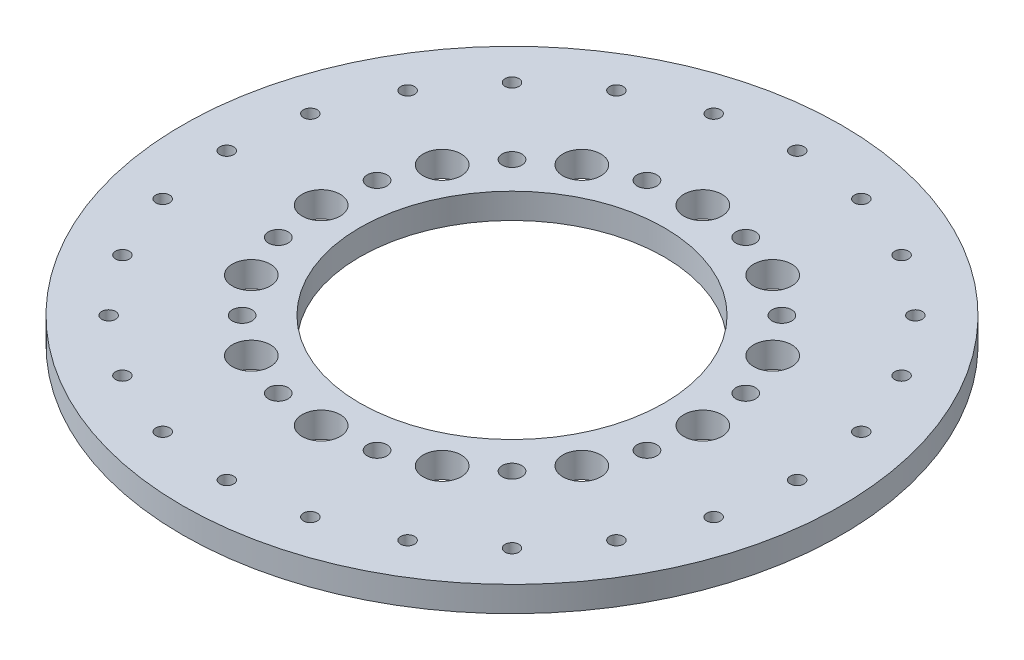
ISO-10303-21;
HEADER;
FILE_DESCRIPTION(('STEP AP214'),'2;1');
FILE_NAME('part.step','',(''),(''),'','','');
FILE_SCHEMA(('AUTOMOTIVE_DESIGN { 1 0 10303 214 1 1 1 1 }'));
ENDSEC;
DATA;
#1=APPLICATION_CONTEXT('core data for automotive mechanical design processes');
#2=APPLICATION_PROTOCOL_DEFINITION('international standard','automotive_design',2000,#1);
#3=PRODUCT_CONTEXT('',#1,'mechanical');
#4=PRODUCT('Part','Part','',(#3));
#5=PRODUCT_RELATED_PRODUCT_CATEGORY('part','',(#4));
#6=PRODUCT_DEFINITION_FORMATION('','',#4);
#7=PRODUCT_DEFINITION_CONTEXT('part definition',#1,'design');
#8=PRODUCT_DEFINITION('design','',#6,#7);
#9=PRODUCT_DEFINITION_SHAPE('','',#8);
#10=(LENGTH_UNIT() NAMED_UNIT(*) SI_UNIT(.MILLI.,.METRE.));
#11=(NAMED_UNIT(*) PLANE_ANGLE_UNIT() SI_UNIT($,.RADIAN.));
#12=(NAMED_UNIT(*) SI_UNIT($,.STERADIAN.) SOLID_ANGLE_UNIT());
#13=UNCERTAINTY_MEASURE_WITH_UNIT(LENGTH_MEASURE(1.E-05),#10,'distance_accuracy_value','');
#14=(GEOMETRIC_REPRESENTATION_CONTEXT(3) GLOBAL_UNCERTAINTY_ASSIGNED_CONTEXT((#13)) GLOBAL_UNIT_ASSIGNED_CONTEXT((#10,
#11,#12)) REPRESENTATION_CONTEXT('',''));
#15=CARTESIAN_POINT('',(0.,0.,0.));
#16=DIRECTION('',(0.,0.,1.));
#17=DIRECTION('',(1.,0.,0.));
#18=AXIS2_PLACEMENT_3D('',#15,#16,#17);
#19=CARTESIAN_POINT('',(0.,-6.35,0.));
#20=DIRECTION('',(0.,1.,0.));
#21=DIRECTION('',(0.,0.,1.));
#22=AXIS2_PLACEMENT_3D('',#19,#20,#21);
#23=CYLINDRICAL_SURFACE('',#22,82.55);
#24=CARTESIAN_POINT('',(0.,-6.35,0.));
#25=DIRECTION('',(0.,1.,0.));
#26=DIRECTION('',(0.,0.,1.));
#27=AXIS2_PLACEMENT_3D('',#24,#25,#26);
#28=CIRCLE('',#27,82.55);
#29=CARTESIAN_POINT('',(0.,-6.35,82.55));
#30=VERTEX_POINT('',#29);
#31=EDGE_CURVE('E12',#30,#30,#28,.T.);
#32=ORIENTED_EDGE('',*,*,#31,.T.);
#33=EDGE_LOOP('',(#32));
#34=FACE_BOUND('',#33,.T.);
#35=CARTESIAN_POINT('',(0.,0.,0.));
#36=DIRECTION('',(0.,1.,0.));
#37=DIRECTION('',(0.,0.,1.));
#38=AXIS2_PLACEMENT_3D('',#35,#36,#37);
#39=CIRCLE('',#38,82.55);
#40=CARTESIAN_POINT('',(0.,0.,82.55));
#41=VERTEX_POINT('',#40);
#42=EDGE_CURVE('E47',#41,#41,#39,.T.);
#43=ORIENTED_EDGE('',*,*,#42,.F.);
#44=EDGE_LOOP('',(#43));
#45=FACE_BOUND('',#44,.T.);
#46=ADVANCED_FACE('F44',(#34,#45),#23,.T.);
#47=CARTESIAN_POINT('',(0.,-6.35,0.));
#48=DIRECTION('',(0.,1.,0.));
#49=DIRECTION('',(0.,0.,1.));
#50=AXIS2_PLACEMENT_3D('',#47,#48,#49);
#51=PLANE('',#50);
#52=CARTESIAN_POINT('',(-46.173959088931,-6.35,-12.3722750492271));
#53=DIRECTION('',(0.,1.,0.));
#54=DIRECTION('',(0.,0.,1.));
#55=AXIS2_PLACEMENT_3D('',#52,#53,#54);
#56=CIRCLE('',#55,2.45745);
#57=CARTESIAN_POINT('',(-46.173959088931,-6.35,-9.91482504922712));
#58=VERTEX_POINT('',#57);
#59=EDGE_CURVE('E343',#58,#58,#56,.T.);
#60=ORIENTED_EDGE('',*,*,#59,.T.);
#61=EDGE_LOOP('',(#60));
#62=FACE_BOUND('',#61,.T.);
#63=CARTESIAN_POINT('',(-46.1739590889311,-6.35,12.3722750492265));
#64=DIRECTION('',(0.,1.,0.));
#65=DIRECTION('',(0.,0.,1.));
#66=AXIS2_PLACEMENT_3D('',#63,#64,#65);
#67=CIRCLE('',#66,2.45745);
#68=CARTESIAN_POINT('',(-46.1739590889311,-6.35,14.8297250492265));
#69=VERTEX_POINT('',#68);
#70=EDGE_CURVE('E337',#69,#69,#67,.T.);
#71=ORIENTED_EDGE('',*,*,#70,.T.);
#72=EDGE_LOOP('',(#71));
#73=FACE_BOUND('',#72,.T.);
#74=CARTESIAN_POINT('',(-33.8016840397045,-6.35,33.8016840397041));
#75=DIRECTION('',(0.,1.,0.));
#76=DIRECTION('',(0.,0.,1.));
#77=AXIS2_PLACEMENT_3D('',#74,#75,#76);
#78=CIRCLE('',#77,2.45745);
#79=CARTESIAN_POINT('',(-33.8016840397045,-6.35,36.2591340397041));
#80=VERTEX_POINT('',#79);
#81=EDGE_CURVE('E331',#80,#80,#78,.T.);
#82=ORIENTED_EDGE('',*,*,#81,.T.);
#83=EDGE_LOOP('',(#82));
#84=FACE_BOUND('',#83,.T.);
#85=CARTESIAN_POINT('',(-12.372275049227,-6.35,46.173959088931));
#86=DIRECTION('',(0.,1.,0.));
#87=DIRECTION('',(0.,0.,1.));
#88=AXIS2_PLACEMENT_3D('',#85,#86,#87);
#89=CIRCLE('',#88,2.45745);
#90=CARTESIAN_POINT('',(-12.372275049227,-6.35,48.631409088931));
#91=VERTEX_POINT('',#90);
#92=EDGE_CURVE('E325',#91,#91,#89,.T.);
#93=ORIENTED_EDGE('',*,*,#92,.T.);
#94=EDGE_LOOP('',(#93));
#95=FACE_BOUND('',#94,.T.);
#96=CARTESIAN_POINT('',(12.3722750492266,-6.35,46.1739590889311));
#97=DIRECTION('',(0.,1.,0.));
#98=DIRECTION('',(0.,0.,1.));
#99=AXIS2_PLACEMENT_3D('',#96,#97,#98);
#100=CIRCLE('',#99,2.45745);
#101=CARTESIAN_POINT('',(12.3722750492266,-6.35,48.6314090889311));
#102=VERTEX_POINT('',#101);
#103=EDGE_CURVE('E319',#102,#102,#100,.T.);
#104=ORIENTED_EDGE('',*,*,#103,.T.);
#105=EDGE_LOOP('',(#104));
#106=FACE_BOUND('',#105,.T.);
#107=CARTESIAN_POINT('',(33.8016840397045,-6.35,33.8016840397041));
#108=DIRECTION('',(0.,1.,0.));
#109=DIRECTION('',(0.,0.,1.));
#110=AXIS2_PLACEMENT_3D('',#107,#108,#109);
#111=CIRCLE('',#110,2.45745);
#112=CARTESIAN_POINT('',(33.8016840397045,-6.35,36.2591340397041));
#113=VERTEX_POINT('',#112);
#114=EDGE_CURVE('E313',#113,#113,#111,.T.);
#115=ORIENTED_EDGE('',*,*,#114,.T.);
#116=EDGE_LOOP('',(#115));
#117=FACE_BOUND('',#116,.T.);
#118=CARTESIAN_POINT('',(46.173959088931,-6.35,12.3722750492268));
#119=DIRECTION('',(0.,1.,0.));
#120=DIRECTION('',(0.,0.,1.));
#121=AXIS2_PLACEMENT_3D('',#118,#119,#120);
#122=CIRCLE('',#121,2.45745);
#123=CARTESIAN_POINT('',(46.173959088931,-6.35,14.8297250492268));
#124=VERTEX_POINT('',#123);
#125=EDGE_CURVE('E307',#124,#124,#122,.T.);
#126=ORIENTED_EDGE('',*,*,#125,.T.);
#127=EDGE_LOOP('',(#126));
#128=FACE_BOUND('',#127,.T.);
#129=CARTESIAN_POINT('',(46.173959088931,-6.35,-12.3722750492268));
#130=DIRECTION('',(0.,1.,0.));
#131=DIRECTION('',(0.,0.,1.));
#132=AXIS2_PLACEMENT_3D('',#129,#130,#131);
#133=CIRCLE('',#132,2.45745);
#134=CARTESIAN_POINT('',(46.173959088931,-6.35,-9.9148250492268));
#135=VERTEX_POINT('',#134);
#136=EDGE_CURVE('E301',#135,#135,#133,.T.);
#137=ORIENTED_EDGE('',*,*,#136,.T.);
#138=EDGE_LOOP('',(#137));
#139=FACE_BOUND('',#138,.T.);
#140=CARTESIAN_POINT('',(33.8016840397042,-6.35,-33.8016840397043));
#141=DIRECTION('',(0.,1.,0.));
#142=DIRECTION('',(0.,0.,1.));
#143=AXIS2_PLACEMENT_3D('',#140,#141,#142);
#144=CIRCLE('',#143,2.45745);
#145=CARTESIAN_POINT('',(33.8016840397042,-6.35,-31.3442340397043));
#146=VERTEX_POINT('',#145);
#147=EDGE_CURVE('E295',#146,#146,#144,.T.);
#148=ORIENTED_EDGE('',*,*,#147,.T.);
#149=EDGE_LOOP('',(#148));
#150=FACE_BOUND('',#149,.T.);
#151=CARTESIAN_POINT('',(12.3722750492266,-6.35,-46.1739590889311));
#152=DIRECTION('',(0.,1.,0.));
#153=DIRECTION('',(0.,0.,1.));
#154=AXIS2_PLACEMENT_3D('',#151,#152,#153);
#155=CIRCLE('',#154,2.45745);
#156=CARTESIAN_POINT('',(12.3722750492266,-6.35,-43.7165090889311));
#157=VERTEX_POINT('',#156);
#158=EDGE_CURVE('E289',#157,#157,#155,.T.);
#159=ORIENTED_EDGE('',*,*,#158,.T.);
#160=EDGE_LOOP('',(#159));
#161=FACE_BOUND('',#160,.T.);
#162=CARTESIAN_POINT('',(-12.372275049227,-6.35,-46.173959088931));
#163=DIRECTION('',(0.,1.,0.));
#164=DIRECTION('',(0.,0.,1.));
#165=AXIS2_PLACEMENT_3D('',#162,#163,#164);
#166=CIRCLE('',#165,2.45745);
#167=CARTESIAN_POINT('',(-12.372275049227,-6.35,-43.716509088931));
#168=VERTEX_POINT('',#167);
#169=EDGE_CURVE('E283',#168,#168,#166,.T.);
#170=ORIENTED_EDGE('',*,*,#169,.T.);
#171=EDGE_LOOP('',(#170));
#172=FACE_BOUND('',#171,.T.);
#173=CARTESIAN_POINT('',(-33.8016840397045,-6.35,-33.8016840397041));
#174=DIRECTION('',(0.,1.,0.));
#175=DIRECTION('',(0.,0.,1.));
#176=AXIS2_PLACEMENT_3D('',#173,#174,#175);
#177=CIRCLE('',#176,2.45745);
#178=CARTESIAN_POINT('',(-33.8016840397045,-6.35,-31.3442340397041));
#179=VERTEX_POINT('',#178);
#180=EDGE_CURVE('E277',#179,#179,#177,.T.);
#181=ORIENTED_EDGE('',*,*,#180,.T.);
#182=EDGE_LOOP('',(#181));
#183=FACE_BOUND('',#182,.T.);
#184=CARTESIAN_POINT('',(-23.9013999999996,-6.35,-41.398439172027));
#185=DIRECTION('',(0.,1.,0.));
#186=DIRECTION('',(0.,0.,1.));
#187=AXIS2_PLACEMENT_3D('',#184,#185,#186);
#188=CIRCLE('',#187,4.7625);
#189=CARTESIAN_POINT('',(-23.9013999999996,-6.35,-36.635939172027));
#190=VERTEX_POINT('',#189);
#191=EDGE_CURVE('E271',#190,#190,#188,.T.);
#192=ORIENTED_EDGE('',*,*,#191,.T.);
#193=EDGE_LOOP('',(#192));
#194=FACE_BOUND('',#193,.T.);
#195=CARTESIAN_POINT('',(-41.3984391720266,-6.35,-23.9014000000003));
#196=DIRECTION('',(0.,1.,0.));
#197=DIRECTION('',(0.,0.,1.));
#198=AXIS2_PLACEMENT_3D('',#195,#196,#197);
#199=CIRCLE('',#198,4.7625);
#200=CARTESIAN_POINT('',(-41.3984391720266,-6.35,-19.1389000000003));
#201=VERTEX_POINT('',#200);
#202=EDGE_CURVE('E265',#201,#201,#199,.T.);
#203=ORIENTED_EDGE('',*,*,#202,.T.);
#204=EDGE_LOOP('',(#203));
#205=FACE_BOUND('',#204,.T.);
#206=CARTESIAN_POINT('',(-47.8028,-6.35,-3.3493315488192E-13));
#207=DIRECTION('',(0.,1.,0.));
#208=DIRECTION('',(0.,0.,1.));
#209=AXIS2_PLACEMENT_3D('',#206,#207,#208);
#210=CIRCLE('',#209,4.7625);
#211=CARTESIAN_POINT('',(-47.8028,-6.35,4.76249999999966));
#212=VERTEX_POINT('',#211);
#213=EDGE_CURVE('E259',#212,#212,#210,.T.);
#214=ORIENTED_EDGE('',*,*,#213,.T.);
#215=EDGE_LOOP('',(#214));
#216=FACE_BOUND('',#215,.T.);
#217=CARTESIAN_POINT('',(-41.3984391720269,-6.35,23.9013999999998));
#218=DIRECTION('',(0.,1.,0.));
#219=DIRECTION('',(0.,0.,1.));
#220=AXIS2_PLACEMENT_3D('',#217,#218,#219);
#221=CIRCLE('',#220,4.7625);
#222=CARTESIAN_POINT('',(-41.3984391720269,-6.35,28.6638999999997));
#223=VERTEX_POINT('',#222);
#224=EDGE_CURVE('E253',#223,#223,#221,.T.);
#225=ORIENTED_EDGE('',*,*,#224,.T.);
#226=EDGE_LOOP('',(#225));
#227=FACE_BOUND('',#226,.T.);
#228=CARTESIAN_POINT('',(-23.9014000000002,-6.35,41.3984391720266));
#229=DIRECTION('',(0.,1.,0.));
#230=DIRECTION('',(0.,0.,1.));
#231=AXIS2_PLACEMENT_3D('',#228,#229,#230);
#232=CIRCLE('',#231,4.7625);
#233=CARTESIAN_POINT('',(-23.9014000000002,-6.35,46.1609391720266));
#234=VERTEX_POINT('',#233);
#235=EDGE_CURVE('E247',#234,#234,#232,.T.);
#236=ORIENTED_EDGE('',*,*,#235,.T.);
#237=EDGE_LOOP('',(#236));
#238=FACE_BOUND('',#237,.T.);
#239=CARTESIAN_POINT('',(1.65774597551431E-13,-6.35,47.8028));
#240=DIRECTION('',(0.,1.,0.));
#241=DIRECTION('',(0.,0.,1.));
#242=AXIS2_PLACEMENT_3D('',#239,#240,#241);
#243=CIRCLE('',#242,4.7625);
#244=CARTESIAN_POINT('',(1.65774597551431E-13,-6.35,52.5653));
#245=VERTEX_POINT('',#244);
#246=EDGE_CURVE('E241',#245,#245,#243,.T.);
#247=ORIENTED_EDGE('',*,*,#246,.T.);
#248=EDGE_LOOP('',(#247));
#249=FACE_BOUND('',#248,.T.);
#250=CARTESIAN_POINT('',(23.9013999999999,-6.35,41.3984391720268));
#251=DIRECTION('',(0.,1.,0.));
#252=DIRECTION('',(0.,0.,1.));
#253=AXIS2_PLACEMENT_3D('',#250,#251,#252);
#254=CIRCLE('',#253,4.7625);
#255=CARTESIAN_POINT('',(23.9013999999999,-6.35,46.1609391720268));
#256=VERTEX_POINT('',#255);
#257=EDGE_CURVE('E235',#256,#256,#254,.T.);
#258=ORIENTED_EDGE('',*,*,#257,.T.);
#259=EDGE_LOOP('',(#258));
#260=FACE_BOUND('',#259,.T.);
#261=CARTESIAN_POINT('',(41.3984391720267,-6.35,23.9014000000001));
#262=DIRECTION('',(0.,1.,0.));
#263=DIRECTION('',(0.,0.,1.));
#264=AXIS2_PLACEMENT_3D('',#261,#262,#263);
#265=CIRCLE('',#264,4.7625);
#266=CARTESIAN_POINT('',(41.3984391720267,-6.35,28.6639));
#267=VERTEX_POINT('',#266);
#268=EDGE_CURVE('E229',#267,#267,#265,.T.);
#269=ORIENTED_EDGE('',*,*,#268,.T.);
#270=EDGE_LOOP('',(#269));
#271=FACE_BOUND('',#270,.T.);
#272=CARTESIAN_POINT('',(47.8028,-6.35,0.));
#273=DIRECTION('',(0.,1.,0.));
#274=DIRECTION('',(0.,0.,1.));
#275=AXIS2_PLACEMENT_3D('',#272,#273,#274);
#276=CIRCLE('',#275,4.7625);
#277=CARTESIAN_POINT('',(47.8028,-6.35,4.7625));
#278=VERTEX_POINT('',#277);
#279=EDGE_CURVE('E223',#278,#278,#276,.T.);
#280=ORIENTED_EDGE('',*,*,#279,.T.);
#281=EDGE_LOOP('',(#280));
#282=FACE_BOUND('',#281,.T.);
#283=CARTESIAN_POINT('',(41.3984391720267,-6.35,-23.9014));
#284=DIRECTION('',(0.,1.,0.));
#285=DIRECTION('',(0.,0.,1.));
#286=AXIS2_PLACEMENT_3D('',#283,#284,#285);
#287=CIRCLE('',#286,4.7625);
#288=CARTESIAN_POINT('',(41.3984391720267,-6.35,-19.1389));
#289=VERTEX_POINT('',#288);
#290=EDGE_CURVE('E217',#289,#289,#287,.T.);
#291=ORIENTED_EDGE('',*,*,#290,.T.);
#292=EDGE_LOOP('',(#291));
#293=FACE_BOUND('',#292,.T.);
#294=CARTESIAN_POINT('',(23.9013999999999,-6.35,-41.3984391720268));
#295=DIRECTION('',(0.,1.,0.));
#296=DIRECTION('',(0.,0.,1.));
#297=AXIS2_PLACEMENT_3D('',#294,#295,#296);
#298=CIRCLE('',#297,4.7625);
#299=CARTESIAN_POINT('',(23.9013999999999,-6.35,-36.6359391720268));
#300=VERTEX_POINT('',#299);
#301=EDGE_CURVE('E211',#300,#300,#298,.T.);
#302=ORIENTED_EDGE('',*,*,#301,.T.);
#303=EDGE_LOOP('',(#302));
#304=FACE_BOUND('',#303,.T.);
#305=CARTESIAN_POINT('',(-1.65774597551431E-13,-6.35,-47.8028));
#306=DIRECTION('',(0.,1.,0.));
#307=DIRECTION('',(0.,0.,1.));
#308=AXIS2_PLACEMENT_3D('',#305,#306,#307);
#309=CIRCLE('',#308,4.7625);
#310=CARTESIAN_POINT('',(-1.65774597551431E-13,-6.35,-43.0403));
#311=VERTEX_POINT('',#310);
#312=EDGE_CURVE('E205',#311,#311,#309,.T.);
#313=ORIENTED_EDGE('',*,*,#312,.T.);
#314=EDGE_LOOP('',(#313));
#315=FACE_BOUND('',#314,.T.);
#316=CARTESIAN_POINT('',(-18.4893855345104,-6.35,-69.0033262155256));
#317=DIRECTION('',(0.,1.,0.));
#318=DIRECTION('',(0.,0.,1.));
#319=AXIS2_PLACEMENT_3D('',#316,#317,#318);
#320=CIRCLE('',#319,1.7272);
#321=CARTESIAN_POINT('',(-18.4893855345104,-6.35,-67.2761262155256));
#322=VERTEX_POINT('',#321);
#323=EDGE_CURVE('E199',#322,#322,#320,.T.);
#324=ORIENTED_EDGE('',*,*,#323,.T.);
#325=EDGE_LOOP('',(#324));
#326=FACE_BOUND('',#325,.T.);
#327=CARTESIAN_POINT('',(-35.7187499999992,-6.35,-61.8666897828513));
#328=DIRECTION('',(0.,1.,0.));
#329=DIRECTION('',(0.,0.,1.));
#330=AXIS2_PLACEMENT_3D('',#327,#328,#329);
#331=CIRCLE('',#330,1.7272);
#332=CARTESIAN_POINT('',(-35.7187499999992,-6.35,-60.1394897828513));
#333=VERTEX_POINT('',#332);
#334=EDGE_CURVE('E193',#333,#333,#331,.T.);
#335=ORIENTED_EDGE('',*,*,#334,.T.);
#336=EDGE_LOOP('',(#335));
#337=FACE_BOUND('',#336,.T.);
#338=CARTESIAN_POINT('',(-50.5139406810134,-6.35,-50.5139406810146));
#339=DIRECTION('',(0.,1.,0.));
#340=DIRECTION('',(0.,0.,1.));
#341=AXIS2_PLACEMENT_3D('',#338,#339,#340);
#342=CIRCLE('',#341,1.7272);
#343=CARTESIAN_POINT('',(-50.5139406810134,-6.35,-48.7867406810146));
#344=VERTEX_POINT('',#343);
#345=EDGE_CURVE('E187',#344,#344,#342,.T.);
#346=ORIENTED_EDGE('',*,*,#345,.T.);
#347=EDGE_LOOP('',(#346));
#348=FACE_BOUND('',#347,.T.);
#349=CARTESIAN_POINT('',(-61.8666897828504,-6.35,-35.7187500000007));
#350=DIRECTION('',(0.,1.,0.));
#351=DIRECTION('',(0.,0.,1.));
#352=AXIS2_PLACEMENT_3D('',#349,#350,#351);
#353=CIRCLE('',#352,1.7272);
#354=CARTESIAN_POINT('',(-61.8666897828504,-6.35,-33.9915500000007));
#355=VERTEX_POINT('',#354);
#356=EDGE_CURVE('E181',#355,#355,#353,.T.);
#357=ORIENTED_EDGE('',*,*,#356,.T.);
#358=EDGE_LOOP('',(#357));
#359=FACE_BOUND('',#358,.T.);
#360=CARTESIAN_POINT('',(-69.0033262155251,-6.35,-18.4893855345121));
#361=DIRECTION('',(0.,1.,0.));
#362=DIRECTION('',(0.,0.,1.));
#363=AXIS2_PLACEMENT_3D('',#360,#361,#362);
#364=CIRCLE('',#363,1.7272);
#365=CARTESIAN_POINT('',(-69.0033262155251,-6.35,-16.7621855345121));
#366=VERTEX_POINT('',#365);
#367=EDGE_CURVE('E175',#366,#366,#364,.T.);
#368=ORIENTED_EDGE('',*,*,#367,.T.);
#369=EDGE_LOOP('',(#368));
#370=FACE_BOUND('',#369,.T.);
#371=CARTESIAN_POINT('',(-71.4375,-6.35,-7.48268094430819E-13));
#372=DIRECTION('',(0.,1.,0.));
#373=DIRECTION('',(0.,0.,1.));
#374=AXIS2_PLACEMENT_3D('',#371,#372,#373);
#375=CIRCLE('',#374,1.7272);
#376=CARTESIAN_POINT('',(-71.4375,-6.35,1.72719999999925));
#377=VERTEX_POINT('',#376);
#378=EDGE_CURVE('E169',#377,#377,#375,.T.);
#379=ORIENTED_EDGE('',*,*,#378,.T.);
#380=EDGE_LOOP('',(#379));
#381=FACE_BOUND('',#380,.T.);
#382=CARTESIAN_POINT('',(-69.0033262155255,-6.35,18.4893855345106));
#383=DIRECTION('',(0.,1.,0.));
#384=DIRECTION('',(0.,0.,1.));
#385=AXIS2_PLACEMENT_3D('',#382,#383,#384);
#386=CIRCLE('',#385,1.7272);
#387=CARTESIAN_POINT('',(-69.0033262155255,-6.35,20.2165855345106));
#388=VERTEX_POINT('',#387);
#389=EDGE_CURVE('E163',#388,#388,#386,.T.);
#390=ORIENTED_EDGE('',*,*,#389,.T.);
#391=EDGE_LOOP('',(#390));
#392=FACE_BOUND('',#391,.T.);
#393=CARTESIAN_POINT('',(-61.8666897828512,-6.35,35.7187499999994));
#394=DIRECTION('',(0.,1.,0.));
#395=DIRECTION('',(0.,0.,1.));
#396=AXIS2_PLACEMENT_3D('',#393,#394,#395);
#397=CIRCLE('',#396,1.7272);
#398=CARTESIAN_POINT('',(-61.8666897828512,-6.35,37.4459499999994));
#399=VERTEX_POINT('',#398);
#400=EDGE_CURVE('E157',#399,#399,#397,.T.);
#401=ORIENTED_EDGE('',*,*,#400,.T.);
#402=EDGE_LOOP('',(#401));
#403=FACE_BOUND('',#402,.T.);
#404=CARTESIAN_POINT('',(-50.5139406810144,-6.35,50.5139406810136));
#405=DIRECTION('',(0.,1.,0.));
#406=DIRECTION('',(0.,0.,1.));
#407=AXIS2_PLACEMENT_3D('',#404,#405,#406);
#408=CIRCLE('',#407,1.7272);
#409=CARTESIAN_POINT('',(-50.5139406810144,-6.35,52.2411406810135));
#410=VERTEX_POINT('',#409);
#411=EDGE_CURVE('E151',#410,#410,#408,.T.);
#412=ORIENTED_EDGE('',*,*,#411,.T.);
#413=EDGE_LOOP('',(#412));
#414=FACE_BOUND('',#413,.T.);
#415=CARTESIAN_POINT('',(-35.7187500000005,-6.35,61.8666897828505));
#416=DIRECTION('',(0.,1.,0.));
#417=DIRECTION('',(0.,0.,1.));
#418=AXIS2_PLACEMENT_3D('',#415,#416,#417);
#419=CIRCLE('',#418,1.7272);
#420=CARTESIAN_POINT('',(-35.7187500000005,-6.35,63.5938897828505));
#421=VERTEX_POINT('',#420);
#422=EDGE_CURVE('E145',#421,#421,#419,.T.);
#423=ORIENTED_EDGE('',*,*,#422,.T.);
#424=EDGE_LOOP('',(#423));
#425=FACE_BOUND('',#424,.T.);
#426=CARTESIAN_POINT('',(-18.4893855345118,-6.35,69.0033262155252));
#427=DIRECTION('',(0.,1.,0.));
#428=DIRECTION('',(0.,0.,1.));
#429=AXIS2_PLACEMENT_3D('',#426,#427,#428);
#430=CIRCLE('',#429,1.7272);
#431=CARTESIAN_POINT('',(-18.4893855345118,-6.35,70.7305262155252));
#432=VERTEX_POINT('',#431);
#433=EDGE_CURVE('E139',#432,#432,#430,.T.);
#434=ORIENTED_EDGE('',*,*,#433,.T.);
#435=EDGE_LOOP('',(#434));
#436=FACE_BOUND('',#435,.T.);
#437=CARTESIAN_POINT('',(0.,-6.35,71.4375));
#438=DIRECTION('',(0.,1.,0.));
#439=DIRECTION('',(0.,0.,1.));
#440=AXIS2_PLACEMENT_3D('',#437,#438,#439);
#441=CIRCLE('',#440,1.7272);
#442=CARTESIAN_POINT('',(0.,-6.35,73.1647));
#443=VERTEX_POINT('',#442);
#444=EDGE_CURVE('E133',#443,#443,#441,.T.);
#445=ORIENTED_EDGE('',*,*,#444,.T.);
#446=EDGE_LOOP('',(#445));
#447=FACE_BOUND('',#446,.T.);
#448=CARTESIAN_POINT('',(18.4893855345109,-6.35,69.0033262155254));
#449=DIRECTION('',(0.,1.,0.));
#450=DIRECTION('',(0.,0.,1.));
#451=AXIS2_PLACEMENT_3D('',#448,#449,#450);
#452=CIRCLE('',#451,1.7272);
#453=CARTESIAN_POINT('',(18.4893855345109,-6.35,70.7305262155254));
#454=VERTEX_POINT('',#453);
#455=EDGE_CURVE('E127',#454,#454,#452,.T.);
#456=ORIENTED_EDGE('',*,*,#455,.T.);
#457=EDGE_LOOP('',(#456));
#458=FACE_BOUND('',#457,.T.);
#459=CARTESIAN_POINT('',(35.7187499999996,-6.35,61.866689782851));
#460=DIRECTION('',(0.,1.,0.));
#461=DIRECTION('',(0.,0.,1.));
#462=AXIS2_PLACEMENT_3D('',#459,#460,#461);
#463=CIRCLE('',#462,1.7272);
#464=CARTESIAN_POINT('',(35.7187499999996,-6.35,63.5938897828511));
#465=VERTEX_POINT('',#464);
#466=EDGE_CURVE('E121',#465,#465,#463,.T.);
#467=ORIENTED_EDGE('',*,*,#466,.T.);
#468=EDGE_LOOP('',(#467));
#469=FACE_BOUND('',#468,.T.);
#470=CARTESIAN_POINT('',(50.5139406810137,-6.35,50.5139406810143));
#471=DIRECTION('',(0.,1.,0.));
#472=DIRECTION('',(0.,0.,1.));
#473=AXIS2_PLACEMENT_3D('',#470,#471,#472);
#474=CIRCLE('',#473,1.7272);
#475=CARTESIAN_POINT('',(50.5139406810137,-6.35,52.2411406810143));
#476=VERTEX_POINT('',#475);
#477=EDGE_CURVE('E115',#476,#476,#474,.T.);
#478=ORIENTED_EDGE('',*,*,#477,.T.);
#479=EDGE_LOOP('',(#478));
#480=FACE_BOUND('',#479,.T.);
#481=CARTESIAN_POINT('',(61.8666897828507,-6.35,35.7187500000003));
#482=DIRECTION('',(0.,1.,0.));
#483=DIRECTION('',(0.,0.,1.));
#484=AXIS2_PLACEMENT_3D('',#481,#482,#483);
#485=CIRCLE('',#484,1.72719999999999);
#486=CARTESIAN_POINT('',(61.8666897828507,-6.35,37.4459500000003));
#487=VERTEX_POINT('',#486);
#488=EDGE_CURVE('E109',#487,#487,#485,.T.);
#489=ORIENTED_EDGE('',*,*,#488,.T.);
#490=EDGE_LOOP('',(#489));
#491=FACE_BOUND('',#490,.T.);
#492=CARTESIAN_POINT('',(69.0033262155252,-6.35,18.4893855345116));
#493=DIRECTION('',(0.,1.,0.));
#494=DIRECTION('',(0.,0.,1.));
#495=AXIS2_PLACEMENT_3D('',#492,#493,#494);
#496=CIRCLE('',#495,1.7272);
#497=CARTESIAN_POINT('',(69.0033262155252,-6.35,20.2165855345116));
#498=VERTEX_POINT('',#497);
#499=EDGE_CURVE('E103',#498,#498,#496,.T.);
#500=ORIENTED_EDGE('',*,*,#499,.T.);
#501=EDGE_LOOP('',(#500));
#502=FACE_BOUND('',#501,.T.);
#503=CARTESIAN_POINT('',(71.4375,-6.35,2.49422698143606E-13));
#504=DIRECTION('',(0.,1.,0.));
#505=DIRECTION('',(0.,0.,1.));
#506=AXIS2_PLACEMENT_3D('',#503,#504,#505);
#507=CIRCLE('',#506,1.7272);
#508=CARTESIAN_POINT('',(71.4375,-6.35,1.72720000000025));
#509=VERTEX_POINT('',#508);
#510=EDGE_CURVE('E97',#509,#509,#507,.T.);
#511=ORIENTED_EDGE('',*,*,#510,.T.);
#512=EDGE_LOOP('',(#511));
#513=FACE_BOUND('',#512,.T.);
#514=CARTESIAN_POINT('',(69.0033262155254,-6.35,-18.4893855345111));
#515=DIRECTION('',(0.,1.,0.));
#516=DIRECTION('',(0.,0.,1.));
#517=AXIS2_PLACEMENT_3D('',#514,#515,#516);
#518=CIRCLE('',#517,1.7272);
#519=CARTESIAN_POINT('',(69.0033262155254,-6.35,-16.7621855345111));
#520=VERTEX_POINT('',#519);
#521=EDGE_CURVE('E91',#520,#520,#518,.T.);
#522=ORIENTED_EDGE('',*,*,#521,.T.);
#523=EDGE_LOOP('',(#522));
#524=FACE_BOUND('',#523,.T.);
#525=CARTESIAN_POINT('',(61.8666897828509,-6.35,-35.7187499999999));
#526=DIRECTION('',(0.,1.,0.));
#527=DIRECTION('',(0.,0.,1.));
#528=AXIS2_PLACEMENT_3D('',#525,#526,#527);
#529=CIRCLE('',#528,1.72719999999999);
#530=CARTESIAN_POINT('',(61.8666897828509,-6.35,-33.9915499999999));
#531=VERTEX_POINT('',#530);
#532=EDGE_CURVE('E85',#531,#531,#529,.T.);
#533=ORIENTED_EDGE('',*,*,#532,.T.);
#534=EDGE_LOOP('',(#533));
#535=FACE_BOUND('',#534,.T.);
#536=CARTESIAN_POINT('',(50.5139406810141,-6.35,-50.5139406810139));
#537=DIRECTION('',(0.,1.,0.));
#538=DIRECTION('',(0.,0.,1.));
#539=AXIS2_PLACEMENT_3D('',#536,#537,#538);
#540=CIRCLE('',#539,1.7272);
#541=CARTESIAN_POINT('',(50.5139406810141,-6.35,-48.7867406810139));
#542=VERTEX_POINT('',#541);
#543=EDGE_CURVE('E79',#542,#542,#540,.T.);
#544=ORIENTED_EDGE('',*,*,#543,.T.);
#545=EDGE_LOOP('',(#544));
#546=FACE_BOUND('',#545,.T.);
#547=CARTESIAN_POINT('',(35.7187500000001,-6.35,-61.8666897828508));
#548=DIRECTION('',(0.,1.,0.));
#549=DIRECTION('',(0.,0.,1.));
#550=AXIS2_PLACEMENT_3D('',#547,#548,#549);
#551=CIRCLE('',#550,1.7272);
#552=CARTESIAN_POINT('',(35.7187500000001,-6.35,-60.1394897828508));
#553=VERTEX_POINT('',#552);
#554=EDGE_CURVE('E73',#553,#553,#551,.T.);
#555=ORIENTED_EDGE('',*,*,#554,.T.);
#556=EDGE_LOOP('',(#555));
#557=FACE_BOUND('',#556,.T.);
#558=CARTESIAN_POINT('',(18.4893855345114,-6.35,-69.0033262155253));
#559=DIRECTION('',(0.,1.,0.));
#560=DIRECTION('',(0.,0.,1.));
#561=AXIS2_PLACEMENT_3D('',#558,#559,#560);
#562=CIRCLE('',#561,1.7272);
#563=CARTESIAN_POINT('',(18.4893855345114,-6.35,-67.2761262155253));
#564=VERTEX_POINT('',#563);
#565=EDGE_CURVE('E67',#564,#564,#562,.T.);
#566=ORIENTED_EDGE('',*,*,#565,.T.);
#567=EDGE_LOOP('',(#566));
#568=FACE_BOUND('',#567,.T.);
#569=CARTESIAN_POINT('',(0.,-6.35,-71.4375));
#570=DIRECTION('',(0.,1.,0.));
#571=DIRECTION('',(0.,0.,1.));
#572=AXIS2_PLACEMENT_3D('',#569,#570,#571);
#573=CIRCLE('',#572,1.7272);
#574=CARTESIAN_POINT('',(0.,-6.35,-69.7103));
#575=VERTEX_POINT('',#574);
#576=EDGE_CURVE('E59',#575,#575,#573,.T.);
#577=ORIENTED_EDGE('',*,*,#576,.T.);
#578=EDGE_LOOP('',(#577));
#579=FACE_BOUND('',#578,.T.);
#580=CARTESIAN_POINT('',(0.,-6.35,0.));
#581=DIRECTION('',(0.,1.,0.));
#582=DIRECTION('',(0.,0.,1.));
#583=AXIS2_PLACEMENT_3D('',#580,#581,#582);
#584=CIRCLE('',#583,38.1);
#585=CARTESIAN_POINT('',(0.,-6.35,38.1));
#586=VERTEX_POINT('',#585);
#587=EDGE_CURVE('E54',#586,#586,#584,.T.);
#588=ORIENTED_EDGE('',*,*,#587,.T.);
#589=EDGE_LOOP('',(#588));
#590=FACE_BOUND('',#589,.T.);
#591=ORIENTED_EDGE('',*,*,#31,.F.);
#592=EDGE_LOOP('',(#591));
#593=FACE_BOUND('',#592,.T.);
#594=ADVANCED_FACE('F356',(#62,#73,#84,#95,#106,#117,#128,#139,#150,#161,#172,#183,#194,#205,
#216,#227,#238,#249,#260,#271,#282,#293,#304,#315,#326,#337,#348,#359,#370,#381,#392,#403,#414,
#425,#436,#447,#458,#469,#480,#491,#502,#513,#524,#535,#546,#557,#568,#579,#590,#593),#51,.F.);
#595=CARTESIAN_POINT('',(0.,0.,0.));
#596=DIRECTION('',(0.,1.,0.));
#597=DIRECTION('',(0.,0.,1.));
#598=AXIS2_PLACEMENT_3D('',#595,#596,#597);
#599=PLANE('',#598);
#600=CARTESIAN_POINT('',(-46.173959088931,0.,-12.3722750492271));
#601=DIRECTION('',(0.,1.,0.));
#602=DIRECTION('',(0.,0.,1.));
#603=AXIS2_PLACEMENT_3D('',#600,#601,#602);
#604=CIRCLE('',#603,2.45745);
#605=CARTESIAN_POINT('',(-46.173959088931,0.,-9.91482504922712));
#606=VERTEX_POINT('',#605);
#607=EDGE_CURVE('E346',#606,#606,#604,.T.);
#608=ORIENTED_EDGE('',*,*,#607,.F.);
#609=EDGE_LOOP('',(#608));
#610=FACE_BOUND('',#609,.T.);
#611=CARTESIAN_POINT('',(-46.1739590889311,0.,12.3722750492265));
#612=DIRECTION('',(0.,1.,0.));
#613=DIRECTION('',(0.,0.,1.));
#614=AXIS2_PLACEMENT_3D('',#611,#612,#613);
#615=CIRCLE('',#614,2.45745);
#616=CARTESIAN_POINT('',(-46.1739590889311,0.,14.8297250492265));
#617=VERTEX_POINT('',#616);
#618=EDGE_CURVE('E340',#617,#617,#615,.T.);
#619=ORIENTED_EDGE('',*,*,#618,.F.);
#620=EDGE_LOOP('',(#619));
#621=FACE_BOUND('',#620,.T.);
#622=CARTESIAN_POINT('',(-33.8016840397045,0.,33.8016840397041));
#623=DIRECTION('',(0.,1.,0.));
#624=DIRECTION('',(0.,0.,1.));
#625=AXIS2_PLACEMENT_3D('',#622,#623,#624);
#626=CIRCLE('',#625,2.45745);
#627=CARTESIAN_POINT('',(-33.8016840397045,0.,36.2591340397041));
#628=VERTEX_POINT('',#627);
#629=EDGE_CURVE('E334',#628,#628,#626,.T.);
#630=ORIENTED_EDGE('',*,*,#629,.F.);
#631=EDGE_LOOP('',(#630));
#632=FACE_BOUND('',#631,.T.);
#633=CARTESIAN_POINT('',(-12.372275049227,0.,46.173959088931));
#634=DIRECTION('',(0.,1.,0.));
#635=DIRECTION('',(0.,0.,1.));
#636=AXIS2_PLACEMENT_3D('',#633,#634,#635);
#637=CIRCLE('',#636,2.45745);
#638=CARTESIAN_POINT('',(-12.372275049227,0.,48.631409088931));
#639=VERTEX_POINT('',#638);
#640=EDGE_CURVE('E328',#639,#639,#637,.T.);
#641=ORIENTED_EDGE('',*,*,#640,.F.);
#642=EDGE_LOOP('',(#641));
#643=FACE_BOUND('',#642,.T.);
#644=CARTESIAN_POINT('',(12.3722750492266,0.,46.1739590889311));
#645=DIRECTION('',(0.,1.,0.));
#646=DIRECTION('',(0.,0.,1.));
#647=AXIS2_PLACEMENT_3D('',#644,#645,#646);
#648=CIRCLE('',#647,2.45745);
#649=CARTESIAN_POINT('',(12.3722750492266,0.,48.6314090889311));
#650=VERTEX_POINT('',#649);
#651=EDGE_CURVE('E322',#650,#650,#648,.T.);
#652=ORIENTED_EDGE('',*,*,#651,.F.);
#653=EDGE_LOOP('',(#652));
#654=FACE_BOUND('',#653,.T.);
#655=CARTESIAN_POINT('',(33.8016840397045,0.,33.8016840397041));
#656=DIRECTION('',(0.,1.,0.));
#657=DIRECTION('',(0.,0.,1.));
#658=AXIS2_PLACEMENT_3D('',#655,#656,#657);
#659=CIRCLE('',#658,2.45745);
#660=CARTESIAN_POINT('',(33.8016840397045,0.,36.2591340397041));
#661=VERTEX_POINT('',#660);
#662=EDGE_CURVE('E316',#661,#661,#659,.T.);
#663=ORIENTED_EDGE('',*,*,#662,.F.);
#664=EDGE_LOOP('',(#663));
#665=FACE_BOUND('',#664,.T.);
#666=CARTESIAN_POINT('',(46.173959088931,0.,12.3722750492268));
#667=DIRECTION('',(0.,1.,0.));
#668=DIRECTION('',(0.,0.,1.));
#669=AXIS2_PLACEMENT_3D('',#666,#667,#668);
#670=CIRCLE('',#669,2.45745);
#671=CARTESIAN_POINT('',(46.173959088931,0.,14.8297250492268));
#672=VERTEX_POINT('',#671);
#673=EDGE_CURVE('E310',#672,#672,#670,.T.);
#674=ORIENTED_EDGE('',*,*,#673,.F.);
#675=EDGE_LOOP('',(#674));
#676=FACE_BOUND('',#675,.T.);
#677=CARTESIAN_POINT('',(46.173959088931,0.,-12.3722750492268));
#678=DIRECTION('',(0.,1.,0.));
#679=DIRECTION('',(0.,0.,1.));
#680=AXIS2_PLACEMENT_3D('',#677,#678,#679);
#681=CIRCLE('',#680,2.45745);
#682=CARTESIAN_POINT('',(46.173959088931,0.,-9.9148250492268));
#683=VERTEX_POINT('',#682);
#684=EDGE_CURVE('E304',#683,#683,#681,.T.);
#685=ORIENTED_EDGE('',*,*,#684,.F.);
#686=EDGE_LOOP('',(#685));
#687=FACE_BOUND('',#686,.T.);
#688=CARTESIAN_POINT('',(33.8016840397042,0.,-33.8016840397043));
#689=DIRECTION('',(0.,1.,0.));
#690=DIRECTION('',(0.,0.,1.));
#691=AXIS2_PLACEMENT_3D('',#688,#689,#690);
#692=CIRCLE('',#691,2.45745);
#693=CARTESIAN_POINT('',(33.8016840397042,0.,-31.3442340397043));
#694=VERTEX_POINT('',#693);
#695=EDGE_CURVE('E298',#694,#694,#692,.T.);
#696=ORIENTED_EDGE('',*,*,#695,.F.);
#697=EDGE_LOOP('',(#696));
#698=FACE_BOUND('',#697,.T.);
#699=CARTESIAN_POINT('',(12.3722750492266,0.,-46.1739590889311));
#700=DIRECTION('',(0.,1.,0.));
#701=DIRECTION('',(0.,0.,1.));
#702=AXIS2_PLACEMENT_3D('',#699,#700,#701);
#703=CIRCLE('',#702,2.45745);
#704=CARTESIAN_POINT('',(12.3722750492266,0.,-43.7165090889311));
#705=VERTEX_POINT('',#704);
#706=EDGE_CURVE('E292',#705,#705,#703,.T.);
#707=ORIENTED_EDGE('',*,*,#706,.F.);
#708=EDGE_LOOP('',(#707));
#709=FACE_BOUND('',#708,.T.);
#710=CARTESIAN_POINT('',(-12.372275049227,0.,-46.173959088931));
#711=DIRECTION('',(0.,1.,0.));
#712=DIRECTION('',(0.,0.,1.));
#713=AXIS2_PLACEMENT_3D('',#710,#711,#712);
#714=CIRCLE('',#713,2.45745);
#715=CARTESIAN_POINT('',(-12.372275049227,0.,-43.716509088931));
#716=VERTEX_POINT('',#715);
#717=EDGE_CURVE('E286',#716,#716,#714,.T.);
#718=ORIENTED_EDGE('',*,*,#717,.F.);
#719=EDGE_LOOP('',(#718));
#720=FACE_BOUND('',#719,.T.);
#721=CARTESIAN_POINT('',(-33.8016840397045,0.,-33.8016840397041));
#722=DIRECTION('',(0.,1.,0.));
#723=DIRECTION('',(0.,0.,1.));
#724=AXIS2_PLACEMENT_3D('',#721,#722,#723);
#725=CIRCLE('',#724,2.45745);
#726=CARTESIAN_POINT('',(-33.8016840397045,0.,-31.3442340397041));
#727=VERTEX_POINT('',#726);
#728=EDGE_CURVE('E280',#727,#727,#725,.T.);
#729=ORIENTED_EDGE('',*,*,#728,.F.);
#730=EDGE_LOOP('',(#729));
#731=FACE_BOUND('',#730,.T.);
#732=CARTESIAN_POINT('',(-23.9013999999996,0.,-41.398439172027));
#733=DIRECTION('',(0.,1.,0.));
#734=DIRECTION('',(0.,0.,1.));
#735=AXIS2_PLACEMENT_3D('',#732,#733,#734);
#736=CIRCLE('',#735,4.76249999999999);
#737=CARTESIAN_POINT('',(-23.9013999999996,0.,-36.635939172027));
#738=VERTEX_POINT('',#737);
#739=EDGE_CURVE('E274',#738,#738,#736,.T.);
#740=ORIENTED_EDGE('',*,*,#739,.F.);
#741=EDGE_LOOP('',(#740));
#742=FACE_BOUND('',#741,.T.);
#743=CARTESIAN_POINT('',(-41.3984391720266,0.,-23.9014000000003));
#744=DIRECTION('',(0.,1.,0.));
#745=DIRECTION('',(0.,0.,1.));
#746=AXIS2_PLACEMENT_3D('',#743,#744,#745);
#747=CIRCLE('',#746,4.76249999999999);
#748=CARTESIAN_POINT('',(-41.3984391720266,0.,-19.1389000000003));
#749=VERTEX_POINT('',#748);
#750=EDGE_CURVE('E268',#749,#749,#747,.T.);
#751=ORIENTED_EDGE('',*,*,#750,.F.);
#752=EDGE_LOOP('',(#751));
#753=FACE_BOUND('',#752,.T.);
#754=CARTESIAN_POINT('',(-47.8028,0.,-3.3493315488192E-13));
#755=DIRECTION('',(0.,1.,0.));
#756=DIRECTION('',(0.,0.,1.));
#757=AXIS2_PLACEMENT_3D('',#754,#755,#756);
#758=CIRCLE('',#757,4.76249999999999);
#759=CARTESIAN_POINT('',(-47.8028,0.,4.76249999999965));
#760=VERTEX_POINT('',#759);
#761=EDGE_CURVE('E262',#760,#760,#758,.T.);
#762=ORIENTED_EDGE('',*,*,#761,.F.);
#763=EDGE_LOOP('',(#762));
#764=FACE_BOUND('',#763,.T.);
#765=CARTESIAN_POINT('',(-41.3984391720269,0.,23.9013999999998));
#766=DIRECTION('',(0.,1.,0.));
#767=DIRECTION('',(0.,0.,1.));
#768=AXIS2_PLACEMENT_3D('',#765,#766,#767);
#769=CIRCLE('',#768,4.76249999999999);
#770=CARTESIAN_POINT('',(-41.3984391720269,0.,28.6638999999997));
#771=VERTEX_POINT('',#770);
#772=EDGE_CURVE('E256',#771,#771,#769,.T.);
#773=ORIENTED_EDGE('',*,*,#772,.F.);
#774=EDGE_LOOP('',(#773));
#775=FACE_BOUND('',#774,.T.);
#776=CARTESIAN_POINT('',(-23.9014000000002,0.,41.3984391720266));
#777=DIRECTION('',(0.,1.,0.));
#778=DIRECTION('',(0.,0.,1.));
#779=AXIS2_PLACEMENT_3D('',#776,#777,#778);
#780=CIRCLE('',#779,4.76249999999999);
#781=CARTESIAN_POINT('',(-23.9014000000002,0.,46.1609391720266));
#782=VERTEX_POINT('',#781);
#783=EDGE_CURVE('E250',#782,#782,#780,.T.);
#784=ORIENTED_EDGE('',*,*,#783,.F.);
#785=EDGE_LOOP('',(#784));
#786=FACE_BOUND('',#785,.T.);
#787=CARTESIAN_POINT('',(1.65774597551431E-13,0.,47.8028));
#788=DIRECTION('',(0.,1.,0.));
#789=DIRECTION('',(0.,0.,1.));
#790=AXIS2_PLACEMENT_3D('',#787,#788,#789);
#791=CIRCLE('',#790,4.76249999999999);
#792=CARTESIAN_POINT('',(1.65774597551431E-13,0.,52.5653));
#793=VERTEX_POINT('',#792);
#794=EDGE_CURVE('E244',#793,#793,#791,.T.);
#795=ORIENTED_EDGE('',*,*,#794,.F.);
#796=EDGE_LOOP('',(#795));
#797=FACE_BOUND('',#796,.T.);
#798=CARTESIAN_POINT('',(23.9013999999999,0.,41.3984391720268));
#799=DIRECTION('',(0.,1.,0.));
#800=DIRECTION('',(0.,0.,1.));
#801=AXIS2_PLACEMENT_3D('',#798,#799,#800);
#802=CIRCLE('',#801,4.76249999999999);
#803=CARTESIAN_POINT('',(23.9013999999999,0.,46.1609391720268));
#804=VERTEX_POINT('',#803);
#805=EDGE_CURVE('E238',#804,#804,#802,.T.);
#806=ORIENTED_EDGE('',*,*,#805,.F.);
#807=EDGE_LOOP('',(#806));
#808=FACE_BOUND('',#807,.T.);
#809=CARTESIAN_POINT('',(41.3984391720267,0.,23.9014000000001));
#810=DIRECTION('',(0.,1.,0.));
#811=DIRECTION('',(0.,0.,1.));
#812=AXIS2_PLACEMENT_3D('',#809,#810,#811);
#813=CIRCLE('',#812,4.76249999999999);
#814=CARTESIAN_POINT('',(41.3984391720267,0.,28.6639));
#815=VERTEX_POINT('',#814);
#816=EDGE_CURVE('E232',#815,#815,#813,.T.);
#817=ORIENTED_EDGE('',*,*,#816,.F.);
#818=EDGE_LOOP('',(#817));
#819=FACE_BOUND('',#818,.T.);
#820=CARTESIAN_POINT('',(47.8028,0.,0.));
#821=DIRECTION('',(0.,1.,0.));
#822=DIRECTION('',(0.,0.,1.));
#823=AXIS2_PLACEMENT_3D('',#820,#821,#822);
#824=CIRCLE('',#823,4.76249999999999);
#825=CARTESIAN_POINT('',(47.8028,0.,4.76249999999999));
#826=VERTEX_POINT('',#825);
#827=EDGE_CURVE('E226',#826,#826,#824,.T.);
#828=ORIENTED_EDGE('',*,*,#827,.F.);
#829=EDGE_LOOP('',(#828));
#830=FACE_BOUND('',#829,.T.);
#831=CARTESIAN_POINT('',(41.3984391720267,0.,-23.9014));
#832=DIRECTION('',(0.,1.,0.));
#833=DIRECTION('',(0.,0.,1.));
#834=AXIS2_PLACEMENT_3D('',#831,#832,#833);
#835=CIRCLE('',#834,4.76249999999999);
#836=CARTESIAN_POINT('',(41.3984391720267,0.,-19.1389000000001));
#837=VERTEX_POINT('',#836);
#838=EDGE_CURVE('E220',#837,#837,#835,.T.);
#839=ORIENTED_EDGE('',*,*,#838,.F.);
#840=EDGE_LOOP('',(#839));
#841=FACE_BOUND('',#840,.T.);
#842=CARTESIAN_POINT('',(23.9013999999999,0.,-41.3984391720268));
#843=DIRECTION('',(0.,1.,0.));
#844=DIRECTION('',(0.,0.,1.));
#845=AXIS2_PLACEMENT_3D('',#842,#843,#844);
#846=CIRCLE('',#845,4.76249999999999);
#847=CARTESIAN_POINT('',(23.9013999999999,0.,-36.6359391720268));
#848=VERTEX_POINT('',#847);
#849=EDGE_CURVE('E214',#848,#848,#846,.T.);
#850=ORIENTED_EDGE('',*,*,#849,.F.);
#851=EDGE_LOOP('',(#850));
#852=FACE_BOUND('',#851,.T.);
#853=CARTESIAN_POINT('',(-1.65774597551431E-13,0.,-47.8028));
#854=DIRECTION('',(0.,1.,0.));
#855=DIRECTION('',(0.,0.,1.));
#856=AXIS2_PLACEMENT_3D('',#853,#854,#855);
#857=CIRCLE('',#856,4.76249999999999);
#858=CARTESIAN_POINT('',(-1.65774597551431E-13,0.,-43.0403));
#859=VERTEX_POINT('',#858);
#860=EDGE_CURVE('E208',#859,#859,#857,.T.);
#861=ORIENTED_EDGE('',*,*,#860,.F.);
#862=EDGE_LOOP('',(#861));
#863=FACE_BOUND('',#862,.T.);
#864=CARTESIAN_POINT('',(-18.4893855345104,0.,-69.0033262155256));
#865=DIRECTION('',(0.,1.,0.));
#866=DIRECTION('',(0.,0.,1.));
#867=AXIS2_PLACEMENT_3D('',#864,#865,#866);
#868=CIRCLE('',#867,1.72719999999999);
#869=CARTESIAN_POINT('',(-18.4893855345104,0.,-67.2761262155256));
#870=VERTEX_POINT('',#869);
#871=EDGE_CURVE('E202',#870,#870,#868,.T.);
#872=ORIENTED_EDGE('',*,*,#871,.F.);
#873=EDGE_LOOP('',(#872));
#874=FACE_BOUND('',#873,.T.);
#875=CARTESIAN_POINT('',(-35.7187499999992,0.,-61.8666897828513));
#876=DIRECTION('',(0.,1.,0.));
#877=DIRECTION('',(0.,0.,1.));
#878=AXIS2_PLACEMENT_3D('',#875,#876,#877);
#879=CIRCLE('',#878,1.72719999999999);
#880=CARTESIAN_POINT('',(-35.7187499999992,0.,-60.1394897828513));
#881=VERTEX_POINT('',#880);
#882=EDGE_CURVE('E196',#881,#881,#879,.T.);
#883=ORIENTED_EDGE('',*,*,#882,.F.);
#884=EDGE_LOOP('',(#883));
#885=FACE_BOUND('',#884,.T.);
#886=CARTESIAN_POINT('',(-50.5139406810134,0.,-50.5139406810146));
#887=DIRECTION('',(0.,1.,0.));
#888=DIRECTION('',(0.,0.,1.));
#889=AXIS2_PLACEMENT_3D('',#886,#887,#888);
#890=CIRCLE('',#889,1.72719999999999);
#891=CARTESIAN_POINT('',(-50.5139406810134,0.,-48.7867406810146));
#892=VERTEX_POINT('',#891);
#893=EDGE_CURVE('E190',#892,#892,#890,.T.);
#894=ORIENTED_EDGE('',*,*,#893,.F.);
#895=EDGE_LOOP('',(#894));
#896=FACE_BOUND('',#895,.T.);
#897=CARTESIAN_POINT('',(-61.8666897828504,0.,-35.7187500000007));
#898=DIRECTION('',(0.,1.,0.));
#899=DIRECTION('',(0.,0.,1.));
#900=AXIS2_PLACEMENT_3D('',#897,#898,#899);
#901=CIRCLE('',#900,1.72719999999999);
#902=CARTESIAN_POINT('',(-61.8666897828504,0.,-33.9915500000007));
#903=VERTEX_POINT('',#902);
#904=EDGE_CURVE('E184',#903,#903,#901,.T.);
#905=ORIENTED_EDGE('',*,*,#904,.F.);
#906=EDGE_LOOP('',(#905));
#907=FACE_BOUND('',#906,.T.);
#908=CARTESIAN_POINT('',(-69.0033262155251,0.,-18.4893855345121));
#909=DIRECTION('',(0.,1.,0.));
#910=DIRECTION('',(0.,0.,1.));
#911=AXIS2_PLACEMENT_3D('',#908,#909,#910);
#912=CIRCLE('',#911,1.72719999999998);
#913=CARTESIAN_POINT('',(-69.0033262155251,0.,-16.7621855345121));
#914=VERTEX_POINT('',#913);
#915=EDGE_CURVE('E178',#914,#914,#912,.T.);
#916=ORIENTED_EDGE('',*,*,#915,.F.);
#917=EDGE_LOOP('',(#916));
#918=FACE_BOUND('',#917,.T.);
#919=CARTESIAN_POINT('',(-71.4375,0.,-7.48268094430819E-13));
#920=DIRECTION('',(0.,1.,0.));
#921=DIRECTION('',(0.,0.,1.));
#922=AXIS2_PLACEMENT_3D('',#919,#920,#921);
#923=CIRCLE('',#922,1.72719999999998);
#924=CARTESIAN_POINT('',(-71.4375,0.,1.72719999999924));
#925=VERTEX_POINT('',#924);
#926=EDGE_CURVE('E172',#925,#925,#923,.T.);
#927=ORIENTED_EDGE('',*,*,#926,.F.);
#928=EDGE_LOOP('',(#927));
#929=FACE_BOUND('',#928,.T.);
#930=CARTESIAN_POINT('',(-69.0033262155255,0.,18.4893855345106));
#931=DIRECTION('',(0.,1.,0.));
#932=DIRECTION('',(0.,0.,1.));
#933=AXIS2_PLACEMENT_3D('',#930,#931,#932);
#934=CIRCLE('',#933,1.72719999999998);
#935=CARTESIAN_POINT('',(-69.0033262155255,0.,20.2165855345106));
#936=VERTEX_POINT('',#935);
#937=EDGE_CURVE('E166',#936,#936,#934,.T.);
#938=ORIENTED_EDGE('',*,*,#937,.F.);
#939=EDGE_LOOP('',(#938));
#940=FACE_BOUND('',#939,.T.);
#941=CARTESIAN_POINT('',(-61.8666897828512,0.,35.7187499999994));
#942=DIRECTION('',(0.,1.,0.));
#943=DIRECTION('',(0.,0.,1.));
#944=AXIS2_PLACEMENT_3D('',#941,#942,#943);
#945=CIRCLE('',#944,1.72719999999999);
#946=CARTESIAN_POINT('',(-61.8666897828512,0.,37.4459499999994));
#947=VERTEX_POINT('',#946);
#948=EDGE_CURVE('E160',#947,#947,#945,.T.);
#949=ORIENTED_EDGE('',*,*,#948,.F.);
#950=EDGE_LOOP('',(#949));
#951=FACE_BOUND('',#950,.T.);
#952=CARTESIAN_POINT('',(-50.5139406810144,0.,50.5139406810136));
#953=DIRECTION('',(0.,1.,0.));
#954=DIRECTION('',(0.,0.,1.));
#955=AXIS2_PLACEMENT_3D('',#952,#953,#954);
#956=CIRCLE('',#955,1.72719999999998);
#957=CARTESIAN_POINT('',(-50.5139406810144,0.,52.2411406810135));
#958=VERTEX_POINT('',#957);
#959=EDGE_CURVE('E154',#958,#958,#956,.T.);
#960=ORIENTED_EDGE('',*,*,#959,.F.);
#961=EDGE_LOOP('',(#960));
#962=FACE_BOUND('',#961,.T.);
#963=CARTESIAN_POINT('',(-35.7187500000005,0.,61.8666897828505));
#964=DIRECTION('',(0.,1.,0.));
#965=DIRECTION('',(0.,0.,1.));
#966=AXIS2_PLACEMENT_3D('',#963,#964,#965);
#967=CIRCLE('',#966,1.72719999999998);
#968=CARTESIAN_POINT('',(-35.7187500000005,0.,63.5938897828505));
#969=VERTEX_POINT('',#968);
#970=EDGE_CURVE('E148',#969,#969,#967,.T.);
#971=ORIENTED_EDGE('',*,*,#970,.F.);
#972=EDGE_LOOP('',(#971));
#973=FACE_BOUND('',#972,.T.);
#974=CARTESIAN_POINT('',(-18.4893855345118,0.,69.0033262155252));
#975=DIRECTION('',(0.,1.,0.));
#976=DIRECTION('',(0.,0.,1.));
#977=AXIS2_PLACEMENT_3D('',#974,#975,#976);
#978=CIRCLE('',#977,1.72719999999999);
#979=CARTESIAN_POINT('',(-18.4893855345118,0.,70.7305262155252));
#980=VERTEX_POINT('',#979);
#981=EDGE_CURVE('E142',#980,#980,#978,.T.);
#982=ORIENTED_EDGE('',*,*,#981,.F.);
#983=EDGE_LOOP('',(#982));
#984=FACE_BOUND('',#983,.T.);
#985=CARTESIAN_POINT('',(0.,0.,71.4375));
#986=DIRECTION('',(0.,1.,0.));
#987=DIRECTION('',(0.,0.,1.));
#988=AXIS2_PLACEMENT_3D('',#985,#986,#987);
#989=CIRCLE('',#988,1.72719999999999);
#990=CARTESIAN_POINT('',(0.,0.,73.1647));
#991=VERTEX_POINT('',#990);
#992=EDGE_CURVE('E136',#991,#991,#989,.T.);
#993=ORIENTED_EDGE('',*,*,#992,.F.);
#994=EDGE_LOOP('',(#993));
#995=FACE_BOUND('',#994,.T.);
#996=CARTESIAN_POINT('',(18.4893855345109,0.,69.0033262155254));
#997=DIRECTION('',(0.,1.,0.));
#998=DIRECTION('',(0.,0.,1.));
#999=AXIS2_PLACEMENT_3D('',#996,#997,#998);
#1000=CIRCLE('',#999,1.72719999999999);
#1001=CARTESIAN_POINT('',(18.4893855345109,0.,70.7305262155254));
#1002=VERTEX_POINT('',#1001);
#1003=EDGE_CURVE('E130',#1002,#1002,#1000,.T.);
#1004=ORIENTED_EDGE('',*,*,#1003,.F.);
#1005=EDGE_LOOP('',(#1004));
#1006=FACE_BOUND('',#1005,.T.);
#1007=CARTESIAN_POINT('',(35.7187499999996,0.,61.866689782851));
#1008=DIRECTION('',(0.,1.,0.));
#1009=DIRECTION('',(0.,0.,1.));
#1010=AXIS2_PLACEMENT_3D('',#1007,#1008,#1009);
#1011=CIRCLE('',#1010,1.72719999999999);
#1012=CARTESIAN_POINT('',(35.7187499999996,0.,63.5938897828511));
#1013=VERTEX_POINT('',#1012);
#1014=EDGE_CURVE('E124',#1013,#1013,#1011,.T.);
#1015=ORIENTED_EDGE('',*,*,#1014,.F.);
#1016=EDGE_LOOP('',(#1015));
#1017=FACE_BOUND('',#1016,.T.);
#1018=CARTESIAN_POINT('',(50.5139406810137,0.,50.5139406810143));
#1019=DIRECTION('',(0.,1.,0.));
#1020=DIRECTION('',(0.,0.,1.));
#1021=AXIS2_PLACEMENT_3D('',#1018,#1019,#1020);
#1022=CIRCLE('',#1021,1.72719999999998);
#1023=CARTESIAN_POINT('',(50.5139406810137,0.,52.2411406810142));
#1024=VERTEX_POINT('',#1023);
#1025=EDGE_CURVE('E118',#1024,#1024,#1022,.T.);
#1026=ORIENTED_EDGE('',*,*,#1025,.F.);
#1027=EDGE_LOOP('',(#1026));
#1028=FACE_BOUND('',#1027,.T.);
#1029=CARTESIAN_POINT('',(61.8666897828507,0.,35.7187500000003));
#1030=DIRECTION('',(0.,1.,0.));
#1031=DIRECTION('',(0.,0.,1.));
#1032=AXIS2_PLACEMENT_3D('',#1029,#1030,#1031);
#1033=CIRCLE('',#1032,1.72719999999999);
#1034=CARTESIAN_POINT('',(61.8666897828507,0.,37.4459500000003));
#1035=VERTEX_POINT('',#1034);
#1036=EDGE_CURVE('E112',#1035,#1035,#1033,.T.);
#1037=ORIENTED_EDGE('',*,*,#1036,.F.);
#1038=EDGE_LOOP('',(#1037));
#1039=FACE_BOUND('',#1038,.T.);
#1040=CARTESIAN_POINT('',(69.0033262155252,0.,18.4893855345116));
#1041=DIRECTION('',(0.,1.,0.));
#1042=DIRECTION('',(0.,0.,1.));
#1043=AXIS2_PLACEMENT_3D('',#1040,#1041,#1042);
#1044=CIRCLE('',#1043,1.72719999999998);
#1045=CARTESIAN_POINT('',(69.0033262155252,0.,20.2165855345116));
#1046=VERTEX_POINT('',#1045);
#1047=EDGE_CURVE('E106',#1046,#1046,#1044,.T.);
#1048=ORIENTED_EDGE('',*,*,#1047,.F.);
#1049=EDGE_LOOP('',(#1048));
#1050=FACE_BOUND('',#1049,.T.);
#1051=CARTESIAN_POINT('',(71.4375,0.,2.49422698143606E-13));
#1052=DIRECTION('',(0.,1.,0.));
#1053=DIRECTION('',(0.,0.,1.));
#1054=AXIS2_PLACEMENT_3D('',#1051,#1052,#1053);
#1055=CIRCLE('',#1054,1.72719999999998);
#1056=CARTESIAN_POINT('',(71.4375,0.,1.72720000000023));
#1057=VERTEX_POINT('',#1056);
#1058=EDGE_CURVE('E100',#1057,#1057,#1055,.T.);
#1059=ORIENTED_EDGE('',*,*,#1058,.F.);
#1060=EDGE_LOOP('',(#1059));
#1061=FACE_BOUND('',#1060,.T.);
#1062=CARTESIAN_POINT('',(69.0033262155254,0.,-18.4893855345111));
#1063=DIRECTION('',(0.,1.,0.));
#1064=DIRECTION('',(0.,0.,1.));
#1065=AXIS2_PLACEMENT_3D('',#1062,#1063,#1064);
#1066=CIRCLE('',#1065,1.72719999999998);
#1067=CARTESIAN_POINT('',(69.0033262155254,0.,-16.7621855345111));
#1068=VERTEX_POINT('',#1067);
#1069=EDGE_CURVE('E94',#1068,#1068,#1066,.T.);
#1070=ORIENTED_EDGE('',*,*,#1069,.F.);
#1071=EDGE_LOOP('',(#1070));
#1072=FACE_BOUND('',#1071,.T.);
#1073=CARTESIAN_POINT('',(61.8666897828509,0.,-35.7187499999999));
#1074=DIRECTION('',(0.,1.,0.));
#1075=DIRECTION('',(0.,0.,1.));
#1076=AXIS2_PLACEMENT_3D('',#1073,#1074,#1075);
#1077=CIRCLE('',#1076,1.72719999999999);
#1078=CARTESIAN_POINT('',(61.8666897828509,0.,-33.9915499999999));
#1079=VERTEX_POINT('',#1078);
#1080=EDGE_CURVE('E88',#1079,#1079,#1077,.T.);
#1081=ORIENTED_EDGE('',*,*,#1080,.F.);
#1082=EDGE_LOOP('',(#1081));
#1083=FACE_BOUND('',#1082,.T.);
#1084=CARTESIAN_POINT('',(50.5139406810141,0.,-50.5139406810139));
#1085=DIRECTION('',(0.,1.,0.));
#1086=DIRECTION('',(0.,0.,1.));
#1087=AXIS2_PLACEMENT_3D('',#1084,#1085,#1086);
#1088=CIRCLE('',#1087,1.72719999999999);
#1089=CARTESIAN_POINT('',(50.5139406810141,0.,-48.7867406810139));
#1090=VERTEX_POINT('',#1089);
#1091=EDGE_CURVE('E82',#1090,#1090,#1088,.T.);
#1092=ORIENTED_EDGE('',*,*,#1091,.F.);
#1093=EDGE_LOOP('',(#1092));
#1094=FACE_BOUND('',#1093,.T.);
#1095=CARTESIAN_POINT('',(35.7187500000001,0.,-61.8666897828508));
#1096=DIRECTION('',(0.,1.,0.));
#1097=DIRECTION('',(0.,0.,1.));
#1098=AXIS2_PLACEMENT_3D('',#1095,#1096,#1097);
#1099=CIRCLE('',#1098,1.72719999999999);
#1100=CARTESIAN_POINT('',(35.7187500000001,0.,-60.1394897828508));
#1101=VERTEX_POINT('',#1100);
#1102=EDGE_CURVE('E76',#1101,#1101,#1099,.T.);
#1103=ORIENTED_EDGE('',*,*,#1102,.F.);
#1104=EDGE_LOOP('',(#1103));
#1105=FACE_BOUND('',#1104,.T.);
#1106=CARTESIAN_POINT('',(18.4893855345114,0.,-69.0033262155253));
#1107=DIRECTION('',(0.,1.,0.));
#1108=DIRECTION('',(0.,0.,1.));
#1109=AXIS2_PLACEMENT_3D('',#1106,#1107,#1108);
#1110=CIRCLE('',#1109,1.72719999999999);
#1111=CARTESIAN_POINT('',(18.4893855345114,0.,-67.2761262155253));
#1112=VERTEX_POINT('',#1111);
#1113=EDGE_CURVE('E70',#1112,#1112,#1110,.T.);
#1114=ORIENTED_EDGE('',*,*,#1113,.F.);
#1115=EDGE_LOOP('',(#1114));
#1116=FACE_BOUND('',#1115,.T.);
#1117=CARTESIAN_POINT('',(0.,0.,-71.4375));
#1118=DIRECTION('',(0.,1.,0.));
#1119=DIRECTION('',(0.,0.,1.));
#1120=AXIS2_PLACEMENT_3D('',#1117,#1118,#1119);
#1121=CIRCLE('',#1120,1.72719999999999);
#1122=CARTESIAN_POINT('',(0.,0.,-69.7103));
#1123=VERTEX_POINT('',#1122);
#1124=EDGE_CURVE('E64',#1123,#1123,#1121,.T.);
#1125=ORIENTED_EDGE('',*,*,#1124,.F.);
#1126=EDGE_LOOP('',(#1125));
#1127=FACE_BOUND('',#1126,.T.);
#1128=CARTESIAN_POINT('',(0.,0.,0.));
#1129=DIRECTION('',(0.,1.,0.));
#1130=DIRECTION('',(0.,0.,1.));
#1131=AXIS2_PLACEMENT_3D('',#1128,#1129,#1130);
#1132=CIRCLE('',#1131,38.1);
#1133=CARTESIAN_POINT('',(0.,0.,38.1));
#1134=VERTEX_POINT('',#1133);
#1135=EDGE_CURVE('E56',#1134,#1134,#1132,.T.);
#1136=ORIENTED_EDGE('',*,*,#1135,.F.);
#1137=EDGE_LOOP('',(#1136));
#1138=FACE_BOUND('',#1137,.T.);
#1139=ORIENTED_EDGE('',*,*,#42,.T.);
#1140=EDGE_LOOP('',(#1139));
#1141=FACE_BOUND('',#1140,.T.);
#1142=ADVANCED_FACE('F352',(#610,#621,#632,#643,#654,#665,#676,#687,#698,#709,#720,#731,#742,
#753,#764,#775,#786,#797,#808,#819,#830,#841,#852,#863,#874,#885,#896,#907,#918,#929,#940,#951,
#962,#973,#984,#995,#1006,#1017,#1028,#1039,#1050,#1061,#1072,#1083,#1094,#1105,#1116,#1127,
#1138,#1141),#599,.T.);
#1143=CARTESIAN_POINT('',(0.,-6.35,0.));
#1144=DIRECTION('',(0.,1.,0.));
#1145=DIRECTION('',(0.,0.,1.));
#1146=AXIS2_PLACEMENT_3D('',#1143,#1144,#1145);
#1147=CYLINDRICAL_SURFACE('',#1146,38.1);
#1148=ORIENTED_EDGE('',*,*,#587,.F.);
#1149=EDGE_LOOP('',(#1148));
#1150=FACE_BOUND('',#1149,.T.);
#1151=ORIENTED_EDGE('',*,*,#1135,.T.);
#1152=EDGE_LOOP('',(#1151));
#1153=FACE_BOUND('',#1152,.T.);
#1154=ADVANCED_FACE('F355',(#1150,#1153),#1147,.F.);
#1155=CARTESIAN_POINT('',(0.,0.,-71.4375));
#1156=DIRECTION('',(0.,1.,0.));
#1157=DIRECTION('',(0.,0.,1.));
#1158=AXIS2_PLACEMENT_3D('',#1155,#1156,#1157);
#1159=CYLINDRICAL_SURFACE('',#1158,1.72719999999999);
#1160=ORIENTED_EDGE('',*,*,#576,.F.);
#1161=EDGE_LOOP('',(#1160));
#1162=FACE_BOUND('',#1161,.T.);
#1163=ORIENTED_EDGE('',*,*,#1124,.T.);
#1164=EDGE_LOOP('',(#1163));
#1165=FACE_BOUND('',#1164,.T.);
#1166=ADVANCED_FACE('F467',(#1162,#1165),#1159,.F.);
#1167=CARTESIAN_POINT('',(18.4893855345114,0.,-69.0033262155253));
#1168=DIRECTION('',(0.,1.,0.));
#1169=DIRECTION('',(0.,0.,1.));
#1170=AXIS2_PLACEMENT_3D('',#1167,#1168,#1169);
#1171=CYLINDRICAL_SURFACE('',#1170,1.72719999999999);
#1172=ORIENTED_EDGE('',*,*,#565,.F.);
#1173=EDGE_LOOP('',(#1172));
#1174=FACE_BOUND('',#1173,.T.);
#1175=ORIENTED_EDGE('',*,*,#1113,.T.);
#1176=EDGE_LOOP('',(#1175));
#1177=FACE_BOUND('',#1176,.T.);
#1178=ADVANCED_FACE('F471',(#1174,#1177),#1171,.F.);
#1179=CARTESIAN_POINT('',(35.7187500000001,0.,-61.8666897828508));
#1180=DIRECTION('',(0.,1.,0.));
#1181=DIRECTION('',(0.,0.,1.));
#1182=AXIS2_PLACEMENT_3D('',#1179,#1180,#1181);
#1183=CYLINDRICAL_SURFACE('',#1182,1.72719999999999);
#1184=ORIENTED_EDGE('',*,*,#554,.F.);
#1185=EDGE_LOOP('',(#1184));
#1186=FACE_BOUND('',#1185,.T.);
#1187=ORIENTED_EDGE('',*,*,#1102,.T.);
#1188=EDGE_LOOP('',(#1187));
#1189=FACE_BOUND('',#1188,.T.);
#1190=ADVANCED_FACE('F475',(#1186,#1189),#1183,.F.);
#1191=CARTESIAN_POINT('',(50.5139406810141,0.,-50.5139406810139));
#1192=DIRECTION('',(0.,1.,0.));
#1193=DIRECTION('',(0.,0.,1.));
#1194=AXIS2_PLACEMENT_3D('',#1191,#1192,#1193);
#1195=CYLINDRICAL_SURFACE('',#1194,1.72719999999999);
#1196=ORIENTED_EDGE('',*,*,#543,.F.);
#1197=EDGE_LOOP('',(#1196));
#1198=FACE_BOUND('',#1197,.T.);
#1199=ORIENTED_EDGE('',*,*,#1091,.T.);
#1200=EDGE_LOOP('',(#1199));
#1201=FACE_BOUND('',#1200,.T.);
#1202=ADVANCED_FACE('F479',(#1198,#1201),#1195,.F.);
#1203=CARTESIAN_POINT('',(61.8666897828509,0.,-35.7187499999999));
#1204=DIRECTION('',(0.,1.,0.));
#1205=DIRECTION('',(0.,0.,1.));
#1206=AXIS2_PLACEMENT_3D('',#1203,#1204,#1205);
#1207=CYLINDRICAL_SURFACE('',#1206,1.72719999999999);
#1208=ORIENTED_EDGE('',*,*,#532,.F.);
#1209=EDGE_LOOP('',(#1208));
#1210=FACE_BOUND('',#1209,.T.);
#1211=ORIENTED_EDGE('',*,*,#1080,.T.);
#1212=EDGE_LOOP('',(#1211));
#1213=FACE_BOUND('',#1212,.T.);
#1214=ADVANCED_FACE('F483',(#1210,#1213),#1207,.F.);
#1215=CARTESIAN_POINT('',(69.0033262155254,0.,-18.4893855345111));
#1216=DIRECTION('',(0.,1.,0.));
#1217=DIRECTION('',(0.,0.,1.));
#1218=AXIS2_PLACEMENT_3D('',#1215,#1216,#1217);
#1219=CYLINDRICAL_SURFACE('',#1218,1.72719999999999);
#1220=ORIENTED_EDGE('',*,*,#521,.F.);
#1221=EDGE_LOOP('',(#1220));
#1222=FACE_BOUND('',#1221,.T.);
#1223=ORIENTED_EDGE('',*,*,#1069,.T.);
#1224=EDGE_LOOP('',(#1223));
#1225=FACE_BOUND('',#1224,.T.);
#1226=ADVANCED_FACE('F487',(#1222,#1225),#1219,.F.);
#1227=CARTESIAN_POINT('',(71.4375,0.,2.49422698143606E-13));
#1228=DIRECTION('',(0.,1.,0.));
#1229=DIRECTION('',(0.,0.,1.));
#1230=AXIS2_PLACEMENT_3D('',#1227,#1228,#1229);
#1231=CYLINDRICAL_SURFACE('',#1230,1.72719999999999);
#1232=ORIENTED_EDGE('',*,*,#510,.F.);
#1233=EDGE_LOOP('',(#1232));
#1234=FACE_BOUND('',#1233,.T.);
#1235=ORIENTED_EDGE('',*,*,#1058,.T.);
#1236=EDGE_LOOP('',(#1235));
#1237=FACE_BOUND('',#1236,.T.);
#1238=ADVANCED_FACE('F491',(#1234,#1237),#1231,.F.);
#1239=CARTESIAN_POINT('',(69.0033262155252,0.,18.4893855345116));
#1240=DIRECTION('',(0.,1.,0.));
#1241=DIRECTION('',(0.,0.,1.));
#1242=AXIS2_PLACEMENT_3D('',#1239,#1240,#1241);
#1243=CYLINDRICAL_SURFACE('',#1242,1.72719999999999);
#1244=ORIENTED_EDGE('',*,*,#499,.F.);
#1245=EDGE_LOOP('',(#1244));
#1246=FACE_BOUND('',#1245,.T.);
#1247=ORIENTED_EDGE('',*,*,#1047,.T.);
#1248=EDGE_LOOP('',(#1247));
#1249=FACE_BOUND('',#1248,.T.);
#1250=ADVANCED_FACE('F495',(#1246,#1249),#1243,.F.);
#1251=CARTESIAN_POINT('',(61.8666897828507,0.,35.7187500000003));
#1252=DIRECTION('',(0.,1.,0.));
#1253=DIRECTION('',(0.,0.,1.));
#1254=AXIS2_PLACEMENT_3D('',#1251,#1252,#1253);
#1255=CYLINDRICAL_SURFACE('',#1254,1.72719999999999);
#1256=ORIENTED_EDGE('',*,*,#488,.F.);
#1257=EDGE_LOOP('',(#1256));
#1258=FACE_BOUND('',#1257,.T.);
#1259=ORIENTED_EDGE('',*,*,#1036,.T.);
#1260=EDGE_LOOP('',(#1259));
#1261=FACE_BOUND('',#1260,.T.);
#1262=ADVANCED_FACE('F499',(#1258,#1261),#1255,.F.);
#1263=CARTESIAN_POINT('',(50.5139406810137,0.,50.5139406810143));
#1264=DIRECTION('',(0.,1.,0.));
#1265=DIRECTION('',(0.,0.,1.));
#1266=AXIS2_PLACEMENT_3D('',#1263,#1264,#1265);
#1267=CYLINDRICAL_SURFACE('',#1266,1.72719999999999);
#1268=ORIENTED_EDGE('',*,*,#477,.F.);
#1269=EDGE_LOOP('',(#1268));
#1270=FACE_BOUND('',#1269,.T.);
#1271=ORIENTED_EDGE('',*,*,#1025,.T.);
#1272=EDGE_LOOP('',(#1271));
#1273=FACE_BOUND('',#1272,.T.);
#1274=ADVANCED_FACE('F503',(#1270,#1273),#1267,.F.);
#1275=CARTESIAN_POINT('',(35.7187499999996,0.,61.866689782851));
#1276=DIRECTION('',(0.,1.,0.));
#1277=DIRECTION('',(0.,0.,1.));
#1278=AXIS2_PLACEMENT_3D('',#1275,#1276,#1277);
#1279=CYLINDRICAL_SURFACE('',#1278,1.72719999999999);
#1280=ORIENTED_EDGE('',*,*,#466,.F.);
#1281=EDGE_LOOP('',(#1280));
#1282=FACE_BOUND('',#1281,.T.);
#1283=ORIENTED_EDGE('',*,*,#1014,.T.);
#1284=EDGE_LOOP('',(#1283));
#1285=FACE_BOUND('',#1284,.T.);
#1286=ADVANCED_FACE('F507',(#1282,#1285),#1279,.F.);
#1287=CARTESIAN_POINT('',(18.4893855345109,0.,69.0033262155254));
#1288=DIRECTION('',(0.,1.,0.));
#1289=DIRECTION('',(0.,0.,1.));
#1290=AXIS2_PLACEMENT_3D('',#1287,#1288,#1289);
#1291=CYLINDRICAL_SURFACE('',#1290,1.72719999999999);
#1292=ORIENTED_EDGE('',*,*,#455,.F.);
#1293=EDGE_LOOP('',(#1292));
#1294=FACE_BOUND('',#1293,.T.);
#1295=ORIENTED_EDGE('',*,*,#1003,.T.);
#1296=EDGE_LOOP('',(#1295));
#1297=FACE_BOUND('',#1296,.T.);
#1298=ADVANCED_FACE('F511',(#1294,#1297),#1291,.F.);
#1299=CARTESIAN_POINT('',(0.,0.,71.4375));
#1300=DIRECTION('',(0.,1.,0.));
#1301=DIRECTION('',(0.,0.,1.));
#1302=AXIS2_PLACEMENT_3D('',#1299,#1300,#1301);
#1303=CYLINDRICAL_SURFACE('',#1302,1.72719999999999);
#1304=ORIENTED_EDGE('',*,*,#444,.F.);
#1305=EDGE_LOOP('',(#1304));
#1306=FACE_BOUND('',#1305,.T.);
#1307=ORIENTED_EDGE('',*,*,#992,.T.);
#1308=EDGE_LOOP('',(#1307));
#1309=FACE_BOUND('',#1308,.T.);
#1310=ADVANCED_FACE('F515',(#1306,#1309),#1303,.F.);
#1311=CARTESIAN_POINT('',(-18.4893855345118,0.,69.0033262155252));
#1312=DIRECTION('',(0.,1.,0.));
#1313=DIRECTION('',(0.,0.,1.));
#1314=AXIS2_PLACEMENT_3D('',#1311,#1312,#1313);
#1315=CYLINDRICAL_SURFACE('',#1314,1.72719999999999);
#1316=ORIENTED_EDGE('',*,*,#433,.F.);
#1317=EDGE_LOOP('',(#1316));
#1318=FACE_BOUND('',#1317,.T.);
#1319=ORIENTED_EDGE('',*,*,#981,.T.);
#1320=EDGE_LOOP('',(#1319));
#1321=FACE_BOUND('',#1320,.T.);
#1322=ADVANCED_FACE('F519',(#1318,#1321),#1315,.F.);
#1323=CARTESIAN_POINT('',(-35.7187500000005,0.,61.8666897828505));
#1324=DIRECTION('',(0.,1.,0.));
#1325=DIRECTION('',(0.,0.,1.));
#1326=AXIS2_PLACEMENT_3D('',#1323,#1324,#1325);
#1327=CYLINDRICAL_SURFACE('',#1326,1.72719999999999);
#1328=ORIENTED_EDGE('',*,*,#422,.F.);
#1329=EDGE_LOOP('',(#1328));
#1330=FACE_BOUND('',#1329,.T.);
#1331=ORIENTED_EDGE('',*,*,#970,.T.);
#1332=EDGE_LOOP('',(#1331));
#1333=FACE_BOUND('',#1332,.T.);
#1334=ADVANCED_FACE('F523',(#1330,#1333),#1327,.F.);
#1335=CARTESIAN_POINT('',(-50.5139406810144,0.,50.5139406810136));
#1336=DIRECTION('',(0.,1.,0.));
#1337=DIRECTION('',(0.,0.,1.));
#1338=AXIS2_PLACEMENT_3D('',#1335,#1336,#1337);
#1339=CYLINDRICAL_SURFACE('',#1338,1.72719999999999);
#1340=ORIENTED_EDGE('',*,*,#411,.F.);
#1341=EDGE_LOOP('',(#1340));
#1342=FACE_BOUND('',#1341,.T.);
#1343=ORIENTED_EDGE('',*,*,#959,.T.);
#1344=EDGE_LOOP('',(#1343));
#1345=FACE_BOUND('',#1344,.T.);
#1346=ADVANCED_FACE('F527',(#1342,#1345),#1339,.F.);
#1347=CARTESIAN_POINT('',(-61.8666897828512,0.,35.7187499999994));
#1348=DIRECTION('',(0.,1.,0.));
#1349=DIRECTION('',(0.,0.,1.));
#1350=AXIS2_PLACEMENT_3D('',#1347,#1348,#1349);
#1351=CYLINDRICAL_SURFACE('',#1350,1.72719999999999);
#1352=ORIENTED_EDGE('',*,*,#400,.F.);
#1353=EDGE_LOOP('',(#1352));
#1354=FACE_BOUND('',#1353,.T.);
#1355=ORIENTED_EDGE('',*,*,#948,.T.);
#1356=EDGE_LOOP('',(#1355));
#1357=FACE_BOUND('',#1356,.T.);
#1358=ADVANCED_FACE('F531',(#1354,#1357),#1351,.F.);
#1359=CARTESIAN_POINT('',(-69.0033262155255,0.,18.4893855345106));
#1360=DIRECTION('',(0.,1.,0.));
#1361=DIRECTION('',(0.,0.,1.));
#1362=AXIS2_PLACEMENT_3D('',#1359,#1360,#1361);
#1363=CYLINDRICAL_SURFACE('',#1362,1.72719999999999);
#1364=ORIENTED_EDGE('',*,*,#389,.F.);
#1365=EDGE_LOOP('',(#1364));
#1366=FACE_BOUND('',#1365,.T.);
#1367=ORIENTED_EDGE('',*,*,#937,.T.);
#1368=EDGE_LOOP('',(#1367));
#1369=FACE_BOUND('',#1368,.T.);
#1370=ADVANCED_FACE('F535',(#1366,#1369),#1363,.F.);
#1371=CARTESIAN_POINT('',(-71.4375,0.,-7.48268094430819E-13));
#1372=DIRECTION('',(0.,1.,0.));
#1373=DIRECTION('',(0.,0.,1.));
#1374=AXIS2_PLACEMENT_3D('',#1371,#1372,#1373);
#1375=CYLINDRICAL_SURFACE('',#1374,1.72719999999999);
#1376=ORIENTED_EDGE('',*,*,#378,.F.);
#1377=EDGE_LOOP('',(#1376));
#1378=FACE_BOUND('',#1377,.T.);
#1379=ORIENTED_EDGE('',*,*,#926,.T.);
#1380=EDGE_LOOP('',(#1379));
#1381=FACE_BOUND('',#1380,.T.);
#1382=ADVANCED_FACE('F539',(#1378,#1381),#1375,.F.);
#1383=CARTESIAN_POINT('',(-69.0033262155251,0.,-18.4893855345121));
#1384=DIRECTION('',(0.,1.,0.));
#1385=DIRECTION('',(0.,0.,1.));
#1386=AXIS2_PLACEMENT_3D('',#1383,#1384,#1385);
#1387=CYLINDRICAL_SURFACE('',#1386,1.72719999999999);
#1388=ORIENTED_EDGE('',*,*,#367,.F.);
#1389=EDGE_LOOP('',(#1388));
#1390=FACE_BOUND('',#1389,.T.);
#1391=ORIENTED_EDGE('',*,*,#915,.T.);
#1392=EDGE_LOOP('',(#1391));
#1393=FACE_BOUND('',#1392,.T.);
#1394=ADVANCED_FACE('F543',(#1390,#1393),#1387,.F.);
#1395=CARTESIAN_POINT('',(-61.8666897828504,0.,-35.7187500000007));
#1396=DIRECTION('',(0.,1.,0.));
#1397=DIRECTION('',(0.,0.,1.));
#1398=AXIS2_PLACEMENT_3D('',#1395,#1396,#1397);
#1399=CYLINDRICAL_SURFACE('',#1398,1.72719999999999);
#1400=ORIENTED_EDGE('',*,*,#356,.F.);
#1401=EDGE_LOOP('',(#1400));
#1402=FACE_BOUND('',#1401,.T.);
#1403=ORIENTED_EDGE('',*,*,#904,.T.);
#1404=EDGE_LOOP('',(#1403));
#1405=FACE_BOUND('',#1404,.T.);
#1406=ADVANCED_FACE('F547',(#1402,#1405),#1399,.F.);
#1407=CARTESIAN_POINT('',(-50.5139406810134,0.,-50.5139406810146));
#1408=DIRECTION('',(0.,1.,0.));
#1409=DIRECTION('',(0.,0.,1.));
#1410=AXIS2_PLACEMENT_3D('',#1407,#1408,#1409);
#1411=CYLINDRICAL_SURFACE('',#1410,1.72719999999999);
#1412=ORIENTED_EDGE('',*,*,#345,.F.);
#1413=EDGE_LOOP('',(#1412));
#1414=FACE_BOUND('',#1413,.T.);
#1415=ORIENTED_EDGE('',*,*,#893,.T.);
#1416=EDGE_LOOP('',(#1415));
#1417=FACE_BOUND('',#1416,.T.);
#1418=ADVANCED_FACE('F551',(#1414,#1417),#1411,.F.);
#1419=CARTESIAN_POINT('',(-35.7187499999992,0.,-61.8666897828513));
#1420=DIRECTION('',(0.,1.,0.));
#1421=DIRECTION('',(0.,0.,1.));
#1422=AXIS2_PLACEMENT_3D('',#1419,#1420,#1421);
#1423=CYLINDRICAL_SURFACE('',#1422,1.72719999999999);
#1424=ORIENTED_EDGE('',*,*,#334,.F.);
#1425=EDGE_LOOP('',(#1424));
#1426=FACE_BOUND('',#1425,.T.);
#1427=ORIENTED_EDGE('',*,*,#882,.T.);
#1428=EDGE_LOOP('',(#1427));
#1429=FACE_BOUND('',#1428,.T.);
#1430=ADVANCED_FACE('F555',(#1426,#1429),#1423,.F.);
#1431=CARTESIAN_POINT('',(-18.4893855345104,0.,-69.0033262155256));
#1432=DIRECTION('',(0.,1.,0.));
#1433=DIRECTION('',(0.,0.,1.));
#1434=AXIS2_PLACEMENT_3D('',#1431,#1432,#1433);
#1435=CYLINDRICAL_SURFACE('',#1434,1.72719999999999);
#1436=ORIENTED_EDGE('',*,*,#323,.F.);
#1437=EDGE_LOOP('',(#1436));
#1438=FACE_BOUND('',#1437,.T.);
#1439=ORIENTED_EDGE('',*,*,#871,.T.);
#1440=EDGE_LOOP('',(#1439));
#1441=FACE_BOUND('',#1440,.T.);
#1442=ADVANCED_FACE('F559',(#1438,#1441),#1435,.F.);
#1443=CARTESIAN_POINT('',(-1.65774597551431E-13,0.,-47.8028));
#1444=DIRECTION('',(0.,1.,0.));
#1445=DIRECTION('',(0.,0.,1.));
#1446=AXIS2_PLACEMENT_3D('',#1443,#1444,#1445);
#1447=CYLINDRICAL_SURFACE('',#1446,4.76249999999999);
#1448=ORIENTED_EDGE('',*,*,#312,.F.);
#1449=EDGE_LOOP('',(#1448));
#1450=FACE_BOUND('',#1449,.T.);
#1451=ORIENTED_EDGE('',*,*,#860,.T.);
#1452=EDGE_LOOP('',(#1451));
#1453=FACE_BOUND('',#1452,.T.);
#1454=ADVANCED_FACE('F563',(#1450,#1453),#1447,.F.);
#1455=CARTESIAN_POINT('',(23.9013999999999,0.,-41.3984391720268));
#1456=DIRECTION('',(0.,1.,0.));
#1457=DIRECTION('',(0.,0.,1.));
#1458=AXIS2_PLACEMENT_3D('',#1455,#1456,#1457);
#1459=CYLINDRICAL_SURFACE('',#1458,4.76249999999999);
#1460=ORIENTED_EDGE('',*,*,#301,.F.);
#1461=EDGE_LOOP('',(#1460));
#1462=FACE_BOUND('',#1461,.T.);
#1463=ORIENTED_EDGE('',*,*,#849,.T.);
#1464=EDGE_LOOP('',(#1463));
#1465=FACE_BOUND('',#1464,.T.);
#1466=ADVANCED_FACE('F567',(#1462,#1465),#1459,.F.);
#1467=CARTESIAN_POINT('',(41.3984391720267,0.,-23.9014));
#1468=DIRECTION('',(0.,1.,0.));
#1469=DIRECTION('',(0.,0.,1.));
#1470=AXIS2_PLACEMENT_3D('',#1467,#1468,#1469);
#1471=CYLINDRICAL_SURFACE('',#1470,4.76249999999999);
#1472=ORIENTED_EDGE('',*,*,#290,.F.);
#1473=EDGE_LOOP('',(#1472));
#1474=FACE_BOUND('',#1473,.T.);
#1475=ORIENTED_EDGE('',*,*,#838,.T.);
#1476=EDGE_LOOP('',(#1475));
#1477=FACE_BOUND('',#1476,.T.);
#1478=ADVANCED_FACE('F571',(#1474,#1477),#1471,.F.);
#1479=CARTESIAN_POINT('',(47.8028,0.,0.));
#1480=DIRECTION('',(0.,1.,0.));
#1481=DIRECTION('',(0.,0.,1.));
#1482=AXIS2_PLACEMENT_3D('',#1479,#1480,#1481);
#1483=CYLINDRICAL_SURFACE('',#1482,4.76249999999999);
#1484=ORIENTED_EDGE('',*,*,#279,.F.);
#1485=EDGE_LOOP('',(#1484));
#1486=FACE_BOUND('',#1485,.T.);
#1487=ORIENTED_EDGE('',*,*,#827,.T.);
#1488=EDGE_LOOP('',(#1487));
#1489=FACE_BOUND('',#1488,.T.);
#1490=ADVANCED_FACE('F575',(#1486,#1489),#1483,.F.);
#1491=CARTESIAN_POINT('',(41.3984391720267,0.,23.9014000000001));
#1492=DIRECTION('',(0.,1.,0.));
#1493=DIRECTION('',(0.,0.,1.));
#1494=AXIS2_PLACEMENT_3D('',#1491,#1492,#1493);
#1495=CYLINDRICAL_SURFACE('',#1494,4.76249999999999);
#1496=ORIENTED_EDGE('',*,*,#268,.F.);
#1497=EDGE_LOOP('',(#1496));
#1498=FACE_BOUND('',#1497,.T.);
#1499=ORIENTED_EDGE('',*,*,#816,.T.);
#1500=EDGE_LOOP('',(#1499));
#1501=FACE_BOUND('',#1500,.T.);
#1502=ADVANCED_FACE('F579',(#1498,#1501),#1495,.F.);
#1503=CARTESIAN_POINT('',(23.9013999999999,0.,41.3984391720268));
#1504=DIRECTION('',(0.,1.,0.));
#1505=DIRECTION('',(0.,0.,1.));
#1506=AXIS2_PLACEMENT_3D('',#1503,#1504,#1505);
#1507=CYLINDRICAL_SURFACE('',#1506,4.76249999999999);
#1508=ORIENTED_EDGE('',*,*,#257,.F.);
#1509=EDGE_LOOP('',(#1508));
#1510=FACE_BOUND('',#1509,.T.);
#1511=ORIENTED_EDGE('',*,*,#805,.T.);
#1512=EDGE_LOOP('',(#1511));
#1513=FACE_BOUND('',#1512,.T.);
#1514=ADVANCED_FACE('F583',(#1510,#1513),#1507,.F.);
#1515=CARTESIAN_POINT('',(1.65774597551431E-13,0.,47.8028));
#1516=DIRECTION('',(0.,1.,0.));
#1517=DIRECTION('',(0.,0.,1.));
#1518=AXIS2_PLACEMENT_3D('',#1515,#1516,#1517);
#1519=CYLINDRICAL_SURFACE('',#1518,4.76249999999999);
#1520=ORIENTED_EDGE('',*,*,#246,.F.);
#1521=EDGE_LOOP('',(#1520));
#1522=FACE_BOUND('',#1521,.T.);
#1523=ORIENTED_EDGE('',*,*,#794,.T.);
#1524=EDGE_LOOP('',(#1523));
#1525=FACE_BOUND('',#1524,.T.);
#1526=ADVANCED_FACE('F587',(#1522,#1525),#1519,.F.);
#1527=CARTESIAN_POINT('',(-23.9014000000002,0.,41.3984391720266));
#1528=DIRECTION('',(0.,1.,0.));
#1529=DIRECTION('',(0.,0.,1.));
#1530=AXIS2_PLACEMENT_3D('',#1527,#1528,#1529);
#1531=CYLINDRICAL_SURFACE('',#1530,4.76249999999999);
#1532=ORIENTED_EDGE('',*,*,#235,.F.);
#1533=EDGE_LOOP('',(#1532));
#1534=FACE_BOUND('',#1533,.T.);
#1535=ORIENTED_EDGE('',*,*,#783,.T.);
#1536=EDGE_LOOP('',(#1535));
#1537=FACE_BOUND('',#1536,.T.);
#1538=ADVANCED_FACE('F591',(#1534,#1537),#1531,.F.);
#1539=CARTESIAN_POINT('',(-41.3984391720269,0.,23.9013999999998));
#1540=DIRECTION('',(0.,1.,0.));
#1541=DIRECTION('',(0.,0.,1.));
#1542=AXIS2_PLACEMENT_3D('',#1539,#1540,#1541);
#1543=CYLINDRICAL_SURFACE('',#1542,4.76249999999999);
#1544=ORIENTED_EDGE('',*,*,#224,.F.);
#1545=EDGE_LOOP('',(#1544));
#1546=FACE_BOUND('',#1545,.T.);
#1547=ORIENTED_EDGE('',*,*,#772,.T.);
#1548=EDGE_LOOP('',(#1547));
#1549=FACE_BOUND('',#1548,.T.);
#1550=ADVANCED_FACE('F595',(#1546,#1549),#1543,.F.);
#1551=CARTESIAN_POINT('',(-47.8028,0.,-3.3493315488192E-13));
#1552=DIRECTION('',(0.,1.,0.));
#1553=DIRECTION('',(0.,0.,1.));
#1554=AXIS2_PLACEMENT_3D('',#1551,#1552,#1553);
#1555=CYLINDRICAL_SURFACE('',#1554,4.76249999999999);
#1556=ORIENTED_EDGE('',*,*,#213,.F.);
#1557=EDGE_LOOP('',(#1556));
#1558=FACE_BOUND('',#1557,.T.);
#1559=ORIENTED_EDGE('',*,*,#761,.T.);
#1560=EDGE_LOOP('',(#1559));
#1561=FACE_BOUND('',#1560,.T.);
#1562=ADVANCED_FACE('F599',(#1558,#1561),#1555,.F.);
#1563=CARTESIAN_POINT('',(-41.3984391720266,0.,-23.9014000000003));
#1564=DIRECTION('',(0.,1.,0.));
#1565=DIRECTION('',(0.,0.,1.));
#1566=AXIS2_PLACEMENT_3D('',#1563,#1564,#1565);
#1567=CYLINDRICAL_SURFACE('',#1566,4.76249999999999);
#1568=ORIENTED_EDGE('',*,*,#202,.F.);
#1569=EDGE_LOOP('',(#1568));
#1570=FACE_BOUND('',#1569,.T.);
#1571=ORIENTED_EDGE('',*,*,#750,.T.);
#1572=EDGE_LOOP('',(#1571));
#1573=FACE_BOUND('',#1572,.T.);
#1574=ADVANCED_FACE('F603',(#1570,#1573),#1567,.F.);
#1575=CARTESIAN_POINT('',(-23.9013999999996,0.,-41.398439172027));
#1576=DIRECTION('',(0.,1.,0.));
#1577=DIRECTION('',(0.,0.,1.));
#1578=AXIS2_PLACEMENT_3D('',#1575,#1576,#1577);
#1579=CYLINDRICAL_SURFACE('',#1578,4.76249999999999);
#1580=ORIENTED_EDGE('',*,*,#191,.F.);
#1581=EDGE_LOOP('',(#1580));
#1582=FACE_BOUND('',#1581,.T.);
#1583=ORIENTED_EDGE('',*,*,#739,.T.);
#1584=EDGE_LOOP('',(#1583));
#1585=FACE_BOUND('',#1584,.T.);
#1586=ADVANCED_FACE('F607',(#1582,#1585),#1579,.F.);
#1587=CARTESIAN_POINT('',(-33.8016840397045,0.,-33.8016840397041));
#1588=DIRECTION('',(0.,1.,0.));
#1589=DIRECTION('',(0.,0.,1.));
#1590=AXIS2_PLACEMENT_3D('',#1587,#1588,#1589);
#1591=CYLINDRICAL_SURFACE('',#1590,2.45745);
#1592=ORIENTED_EDGE('',*,*,#180,.F.);
#1593=EDGE_LOOP('',(#1592));
#1594=FACE_BOUND('',#1593,.T.);
#1595=ORIENTED_EDGE('',*,*,#728,.T.);
#1596=EDGE_LOOP('',(#1595));
#1597=FACE_BOUND('',#1596,.T.);
#1598=ADVANCED_FACE('F611',(#1594,#1597),#1591,.F.);
#1599=CARTESIAN_POINT('',(-12.372275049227,0.,-46.173959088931));
#1600=DIRECTION('',(0.,1.,0.));
#1601=DIRECTION('',(0.,0.,1.));
#1602=AXIS2_PLACEMENT_3D('',#1599,#1600,#1601);
#1603=CYLINDRICAL_SURFACE('',#1602,2.45745);
#1604=ORIENTED_EDGE('',*,*,#169,.F.);
#1605=EDGE_LOOP('',(#1604));
#1606=FACE_BOUND('',#1605,.T.);
#1607=ORIENTED_EDGE('',*,*,#717,.T.);
#1608=EDGE_LOOP('',(#1607));
#1609=FACE_BOUND('',#1608,.T.);
#1610=ADVANCED_FACE('F615',(#1606,#1609),#1603,.F.);
#1611=CARTESIAN_POINT('',(12.3722750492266,0.,-46.1739590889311));
#1612=DIRECTION('',(0.,1.,0.));
#1613=DIRECTION('',(0.,0.,1.));
#1614=AXIS2_PLACEMENT_3D('',#1611,#1612,#1613);
#1615=CYLINDRICAL_SURFACE('',#1614,2.45745);
#1616=ORIENTED_EDGE('',*,*,#158,.F.);
#1617=EDGE_LOOP('',(#1616));
#1618=FACE_BOUND('',#1617,.T.);
#1619=ORIENTED_EDGE('',*,*,#706,.T.);
#1620=EDGE_LOOP('',(#1619));
#1621=FACE_BOUND('',#1620,.T.);
#1622=ADVANCED_FACE('F619',(#1618,#1621),#1615,.F.);
#1623=CARTESIAN_POINT('',(33.8016840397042,0.,-33.8016840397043));
#1624=DIRECTION('',(0.,1.,0.));
#1625=DIRECTION('',(0.,0.,1.));
#1626=AXIS2_PLACEMENT_3D('',#1623,#1624,#1625);
#1627=CYLINDRICAL_SURFACE('',#1626,2.45745);
#1628=ORIENTED_EDGE('',*,*,#147,.F.);
#1629=EDGE_LOOP('',(#1628));
#1630=FACE_BOUND('',#1629,.T.);
#1631=ORIENTED_EDGE('',*,*,#695,.T.);
#1632=EDGE_LOOP('',(#1631));
#1633=FACE_BOUND('',#1632,.T.);
#1634=ADVANCED_FACE('F623',(#1630,#1633),#1627,.F.);
#1635=CARTESIAN_POINT('',(46.173959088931,0.,-12.3722750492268));
#1636=DIRECTION('',(0.,1.,0.));
#1637=DIRECTION('',(0.,0.,1.));
#1638=AXIS2_PLACEMENT_3D('',#1635,#1636,#1637);
#1639=CYLINDRICAL_SURFACE('',#1638,2.45745);
#1640=ORIENTED_EDGE('',*,*,#136,.F.);
#1641=EDGE_LOOP('',(#1640));
#1642=FACE_BOUND('',#1641,.T.);
#1643=ORIENTED_EDGE('',*,*,#684,.T.);
#1644=EDGE_LOOP('',(#1643));
#1645=FACE_BOUND('',#1644,.T.);
#1646=ADVANCED_FACE('F627',(#1642,#1645),#1639,.F.);
#1647=CARTESIAN_POINT('',(46.173959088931,0.,12.3722750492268));
#1648=DIRECTION('',(0.,1.,0.));
#1649=DIRECTION('',(0.,0.,1.));
#1650=AXIS2_PLACEMENT_3D('',#1647,#1648,#1649);
#1651=CYLINDRICAL_SURFACE('',#1650,2.45745);
#1652=ORIENTED_EDGE('',*,*,#125,.F.);
#1653=EDGE_LOOP('',(#1652));
#1654=FACE_BOUND('',#1653,.T.);
#1655=ORIENTED_EDGE('',*,*,#673,.T.);
#1656=EDGE_LOOP('',(#1655));
#1657=FACE_BOUND('',#1656,.T.);
#1658=ADVANCED_FACE('F631',(#1654,#1657),#1651,.F.);
#1659=CARTESIAN_POINT('',(33.8016840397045,0.,33.8016840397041));
#1660=DIRECTION('',(0.,1.,0.));
#1661=DIRECTION('',(0.,0.,1.));
#1662=AXIS2_PLACEMENT_3D('',#1659,#1660,#1661);
#1663=CYLINDRICAL_SURFACE('',#1662,2.45745);
#1664=ORIENTED_EDGE('',*,*,#114,.F.);
#1665=EDGE_LOOP('',(#1664));
#1666=FACE_BOUND('',#1665,.T.);
#1667=ORIENTED_EDGE('',*,*,#662,.T.);
#1668=EDGE_LOOP('',(#1667));
#1669=FACE_BOUND('',#1668,.T.);
#1670=ADVANCED_FACE('F635',(#1666,#1669),#1663,.F.);
#1671=CARTESIAN_POINT('',(12.3722750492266,0.,46.1739590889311));
#1672=DIRECTION('',(0.,1.,0.));
#1673=DIRECTION('',(0.,0.,1.));
#1674=AXIS2_PLACEMENT_3D('',#1671,#1672,#1673);
#1675=CYLINDRICAL_SURFACE('',#1674,2.45745);
#1676=ORIENTED_EDGE('',*,*,#103,.F.);
#1677=EDGE_LOOP('',(#1676));
#1678=FACE_BOUND('',#1677,.T.);
#1679=ORIENTED_EDGE('',*,*,#651,.T.);
#1680=EDGE_LOOP('',(#1679));
#1681=FACE_BOUND('',#1680,.T.);
#1682=ADVANCED_FACE('F639',(#1678,#1681),#1675,.F.);
#1683=CARTESIAN_POINT('',(-12.372275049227,0.,46.173959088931));
#1684=DIRECTION('',(0.,1.,0.));
#1685=DIRECTION('',(0.,0.,1.));
#1686=AXIS2_PLACEMENT_3D('',#1683,#1684,#1685);
#1687=CYLINDRICAL_SURFACE('',#1686,2.45745);
#1688=ORIENTED_EDGE('',*,*,#92,.F.);
#1689=EDGE_LOOP('',(#1688));
#1690=FACE_BOUND('',#1689,.T.);
#1691=ORIENTED_EDGE('',*,*,#640,.T.);
#1692=EDGE_LOOP('',(#1691));
#1693=FACE_BOUND('',#1692,.T.);
#1694=ADVANCED_FACE('F643',(#1690,#1693),#1687,.F.);
#1695=CARTESIAN_POINT('',(-33.8016840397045,0.,33.8016840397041));
#1696=DIRECTION('',(0.,1.,0.));
#1697=DIRECTION('',(0.,0.,1.));
#1698=AXIS2_PLACEMENT_3D('',#1695,#1696,#1697);
#1699=CYLINDRICAL_SURFACE('',#1698,2.45745);
#1700=ORIENTED_EDGE('',*,*,#81,.F.);
#1701=EDGE_LOOP('',(#1700));
#1702=FACE_BOUND('',#1701,.T.);
#1703=ORIENTED_EDGE('',*,*,#629,.T.);
#1704=EDGE_LOOP('',(#1703));
#1705=FACE_BOUND('',#1704,.T.);
#1706=ADVANCED_FACE('F647',(#1702,#1705),#1699,.F.);
#1707=CARTESIAN_POINT('',(-46.1739590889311,0.,12.3722750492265));
#1708=DIRECTION('',(0.,1.,0.));
#1709=DIRECTION('',(0.,0.,1.));
#1710=AXIS2_PLACEMENT_3D('',#1707,#1708,#1709);
#1711=CYLINDRICAL_SURFACE('',#1710,2.45745);
#1712=ORIENTED_EDGE('',*,*,#70,.F.);
#1713=EDGE_LOOP('',(#1712));
#1714=FACE_BOUND('',#1713,.T.);
#1715=ORIENTED_EDGE('',*,*,#618,.T.);
#1716=EDGE_LOOP('',(#1715));
#1717=FACE_BOUND('',#1716,.T.);
#1718=ADVANCED_FACE('F651',(#1714,#1717),#1711,.F.);
#1719=CARTESIAN_POINT('',(-46.173959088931,0.,-12.3722750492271));
#1720=DIRECTION('',(0.,1.,0.));
#1721=DIRECTION('',(0.,0.,1.));
#1722=AXIS2_PLACEMENT_3D('',#1719,#1720,#1721);
#1723=CYLINDRICAL_SURFACE('',#1722,2.45745);
#1724=ORIENTED_EDGE('',*,*,#59,.F.);
#1725=EDGE_LOOP('',(#1724));
#1726=FACE_BOUND('',#1725,.T.);
#1727=ORIENTED_EDGE('',*,*,#607,.T.);
#1728=EDGE_LOOP('',(#1727));
#1729=FACE_BOUND('',#1728,.T.);
#1730=ADVANCED_FACE('F350',(#1726,#1729),#1723,.F.);
#1731=CLOSED_SHELL('',(#46,#594,#1142,#1154,#1166,#1178,#1190,#1202,#1214,#1226,#1238,#1250,
#1262,#1274,#1286,#1298,#1310,#1322,#1334,#1346,#1358,#1370,#1382,#1394,#1406,#1418,#1430,#1442,
#1454,#1466,#1478,#1490,#1502,#1514,#1526,#1538,#1550,#1562,#1574,#1586,#1598,#1610,#1622,#1634,
#1646,#1658,#1670,#1682,#1694,#1706,#1718,#1730));
#1732=MANIFOLD_SOLID_BREP('B2',#1731);
#1733=ADVANCED_BREP_SHAPE_REPRESENTATION('',(#18,#1732),#14);
#1734=SHAPE_DEFINITION_REPRESENTATION(#9,#1733);
ENDSEC;
END-ISO-10303-21;
